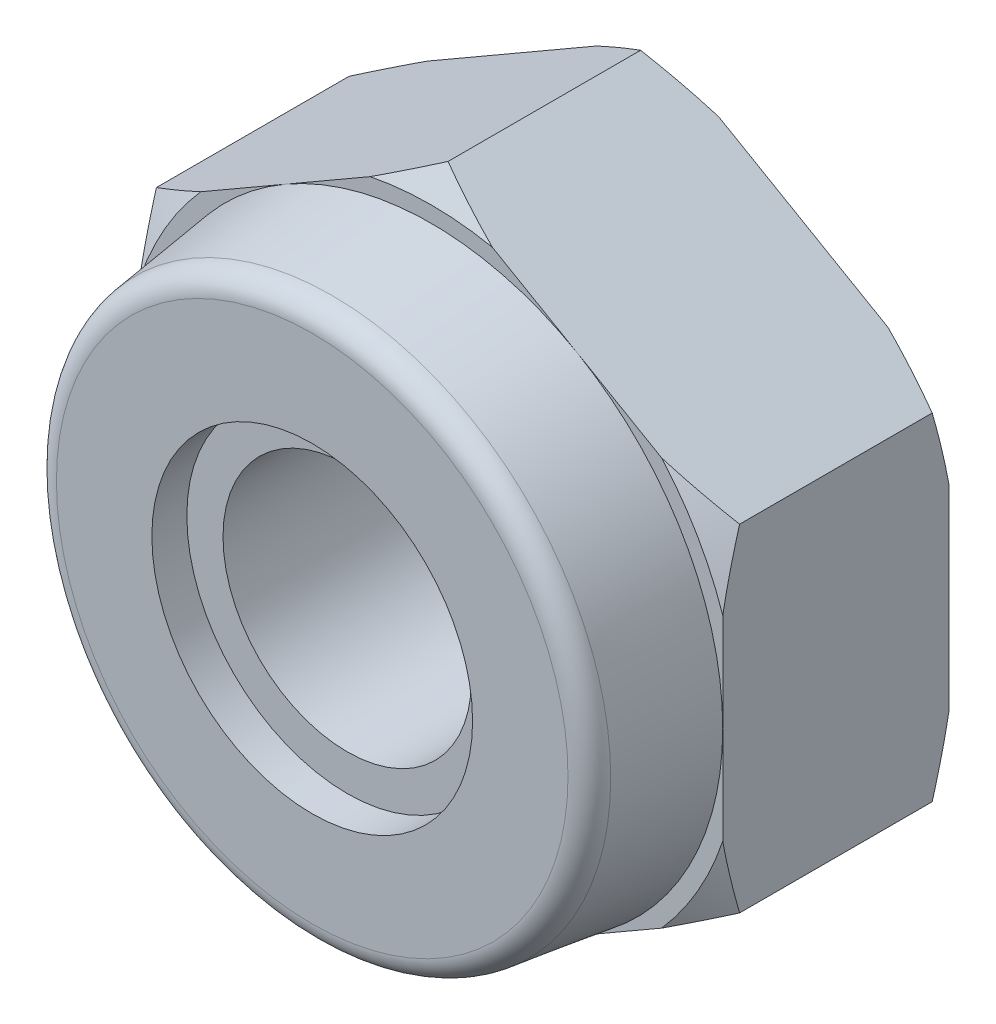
ISO-10303-21;
HEADER;
FILE_DESCRIPTION(('STEP AP214'),'2;1');
FILE_NAME('part.step','',(''),(''),'','','');
FILE_SCHEMA(('AUTOMOTIVE_DESIGN { 1 0 10303 214 1 1 1 1 }'));
ENDSEC;
DATA;
#1=APPLICATION_CONTEXT('core data for automotive mechanical design processes');
#2=APPLICATION_PROTOCOL_DEFINITION('international standard','automotive_design',2000,#1);
#3=PRODUCT_CONTEXT('',#1,'mechanical');
#4=PRODUCT('Part','Part','',(#3));
#5=PRODUCT_RELATED_PRODUCT_CATEGORY('part','',(#4));
#6=PRODUCT_DEFINITION_FORMATION('','',#4);
#7=PRODUCT_DEFINITION_CONTEXT('part definition',#1,'design');
#8=PRODUCT_DEFINITION('design','',#6,#7);
#9=PRODUCT_DEFINITION_SHAPE('','',#8);
#10=(LENGTH_UNIT() NAMED_UNIT(*) SI_UNIT(.MILLI.,.METRE.));
#11=(NAMED_UNIT(*) PLANE_ANGLE_UNIT() SI_UNIT($,.RADIAN.));
#12=(NAMED_UNIT(*) SI_UNIT($,.STERADIAN.) SOLID_ANGLE_UNIT());
#13=UNCERTAINTY_MEASURE_WITH_UNIT(LENGTH_MEASURE(1.E-05),#10,'distance_accuracy_value','');
#14=(GEOMETRIC_REPRESENTATION_CONTEXT(3) GLOBAL_UNCERTAINTY_ASSIGNED_CONTEXT((#13)) GLOBAL_UNIT_ASSIGNED_CONTEXT((#10,
#11,#12)) REPRESENTATION_CONTEXT('',''));
#15=CARTESIAN_POINT('',(0.,0.,0.));
#16=DIRECTION('',(0.,0.,1.));
#17=DIRECTION('',(1.,0.,0.));
#18=AXIS2_PLACEMENT_3D('',#15,#16,#17);
#19=CARTESIAN_POINT('',(-6.35,-10.9985226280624,0.));
#20=DIRECTION('',(0.,0.,-1.));
#21=DIRECTION('',(-1.,0.,0.));
#22=AXIS2_PLACEMENT_3D('',#19,#20,#21);
#23=PLANE('',#22);
#24=CARTESIAN_POINT('',(0.,0.,0.));
#25=DIRECTION('',(0.,0.,1.));
#26=DIRECTION('',(1.,0.,0.));
#27=AXIS2_PLACEMENT_3D('',#24,#25,#26);
#28=CIRCLE('',#27,6.69734841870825);
#29=CARTESIAN_POINT('',(6.35,2.12884378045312,0.));
#30=VERTEX_POINT('',#29);
#31=CARTESIAN_POINT('',(5.01863279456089,4.43483942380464,0.));
#32=VERTEX_POINT('',#31);
#33=EDGE_CURVE('E182',#30,#32,#28,.T.);
#34=ORIENTED_EDGE('',*,*,#33,.T.);
#35=DIRECTION('',(-0.866025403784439,0.5,0.));
#36=VECTOR('',#35,1.);
#37=CARTESIAN_POINT('',(6.35,3.66617420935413,0.));
#38=LINE('',#37,#36);
#39=CARTESIAN_POINT('',(3.175,5.49926131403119,0.));
#40=VERTEX_POINT('',#39);
#41=EDGE_CURVE('E198',#32,#40,#38,.T.);
#42=ORIENTED_EDGE('',*,*,#41,.T.);
#43=CARTESIAN_POINT('',(0.,0.,0.));
#44=DIRECTION('',(0.,0.,1.));
#45=DIRECTION('',(1.,0.,0.));
#46=AXIS2_PLACEMENT_3D('',#43,#44,#45);
#47=CIRCLE('',#46,6.35);
#48=CARTESIAN_POINT('',(6.35,0.,0.));
#49=VERTEX_POINT('',#48);
#50=EDGE_CURVE('E224',#49,#40,#47,.T.);
#51=ORIENTED_EDGE('',*,*,#50,.F.);
#52=DIRECTION('',(0.,1.,0.));
#53=VECTOR('',#52,1.);
#54=CARTESIAN_POINT('',(6.35,-3.66617420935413,0.));
#55=LINE('',#54,#53);
#56=EDGE_CURVE('E270',#49,#30,#55,.T.);
#57=ORIENTED_EDGE('',*,*,#56,.T.);
#58=EDGE_LOOP('',(#34,#42,#51,#57));
#59=FACE_BOUND('',#58,.T.);
#60=ADVANCED_FACE('F35',(#59),#23,.F.);
#61=CARTESIAN_POINT('',(1.33136720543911,6.56368320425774,0.));
#62=VERTEX_POINT('',#61);
#63=CARTESIAN_POINT('',(-1.33136720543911,6.56368320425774,0.));
#64=VERTEX_POINT('',#63);
#65=EDGE_CURVE('E459',#62,#64,#28,.T.);
#66=ORIENTED_EDGE('',*,*,#65,.T.);
#67=DIRECTION('',(-0.866025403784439,-0.5,0.));
#68=VECTOR('',#67,1.);
#69=CARTESIAN_POINT('',(0.,7.33234841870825,0.));
#70=LINE('',#69,#68);
#71=CARTESIAN_POINT('',(-3.175,5.49926131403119,0.));
#72=VERTEX_POINT('',#71);
#73=EDGE_CURVE('E277',#64,#72,#70,.T.);
#74=ORIENTED_EDGE('',*,*,#73,.T.);
#75=EDGE_CURVE('E216',#40,#72,#47,.T.);
#76=ORIENTED_EDGE('',*,*,#75,.F.);
#77=EDGE_CURVE('E274',#40,#62,#38,.T.);
#78=ORIENTED_EDGE('',*,*,#77,.T.);
#79=EDGE_LOOP('',(#66,#74,#76,#78));
#80=FACE_BOUND('',#79,.T.);
#81=ADVANCED_FACE('F399',(#80),#23,.F.);
#82=CARTESIAN_POINT('',(-5.01863279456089,4.43483942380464,0.));
#83=VERTEX_POINT('',#82);
#84=CARTESIAN_POINT('',(-6.35,2.1288437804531,0.));
#85=VERTEX_POINT('',#84);
#86=EDGE_CURVE('E462',#83,#85,#28,.T.);
#87=ORIENTED_EDGE('',*,*,#86,.T.);
#88=DIRECTION('',(0.,-1.,0.));
#89=VECTOR('',#88,1.);
#90=CARTESIAN_POINT('',(-6.35,3.66617420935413,0.));
#91=LINE('',#90,#89);
#92=CARTESIAN_POINT('',(-6.35,0.,0.));
#93=VERTEX_POINT('',#92);
#94=EDGE_CURVE('E280',#85,#93,#91,.T.);
#95=ORIENTED_EDGE('',*,*,#94,.T.);
#96=EDGE_CURVE('E222',#72,#93,#47,.T.);
#97=ORIENTED_EDGE('',*,*,#96,.F.);
#98=EDGE_CURVE('E276',#72,#83,#70,.T.);
#99=ORIENTED_EDGE('',*,*,#98,.T.);
#100=EDGE_LOOP('',(#87,#95,#97,#99));
#101=FACE_BOUND('',#100,.T.);
#102=ADVANCED_FACE('F452',(#101),#23,.F.);
#103=CARTESIAN_POINT('',(-6.35,-2.12884378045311,0.));
#104=VERTEX_POINT('',#103);
#105=CARTESIAN_POINT('',(-5.01863279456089,-4.43483942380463,0.));
#106=VERTEX_POINT('',#105);
#107=EDGE_CURVE('E59',#104,#106,#28,.T.);
#108=ORIENTED_EDGE('',*,*,#107,.T.);
#109=DIRECTION('',(0.866025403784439,-0.5,0.));
#110=VECTOR('',#109,1.);
#111=CARTESIAN_POINT('',(-6.35,-3.66617420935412,0.));
#112=LINE('',#111,#110);
#113=CARTESIAN_POINT('',(-3.175,-5.49926131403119,0.));
#114=VERTEX_POINT('',#113);
#115=EDGE_CURVE('E257',#106,#114,#112,.T.);
#116=ORIENTED_EDGE('',*,*,#115,.T.);
#117=EDGE_CURVE('E446',#93,#114,#47,.T.);
#118=ORIENTED_EDGE('',*,*,#117,.F.);
#119=EDGE_CURVE('E279',#93,#104,#91,.T.);
#120=ORIENTED_EDGE('',*,*,#119,.T.);
#121=EDGE_LOOP('',(#108,#116,#118,#120));
#122=FACE_BOUND('',#121,.T.);
#123=ADVANCED_FACE('F637',(#122),#23,.F.);
#124=CARTESIAN_POINT('',(-1.3313672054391,-6.56368320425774,0.));
#125=VERTEX_POINT('',#124);
#126=CARTESIAN_POINT('',(1.33136720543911,-6.56368320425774,0.));
#127=VERTEX_POINT('',#126);
#128=EDGE_CURVE('E51',#125,#127,#28,.T.);
#129=ORIENTED_EDGE('',*,*,#128,.T.);
#130=DIRECTION('',(0.866025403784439,0.5,0.));
#131=VECTOR('',#130,1.);
#132=CARTESIAN_POINT('',(0.,-7.33234841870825,0.));
#133=LINE('',#132,#131);
#134=CARTESIAN_POINT('',(3.175,-5.49926131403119,0.));
#135=VERTEX_POINT('',#134);
#136=EDGE_CURVE('E268',#127,#135,#133,.T.);
#137=ORIENTED_EDGE('',*,*,#136,.T.);
#138=EDGE_CURVE('E445',#114,#135,#47,.T.);
#139=ORIENTED_EDGE('',*,*,#138,.F.);
#140=EDGE_CURVE('E282',#114,#125,#112,.T.);
#141=ORIENTED_EDGE('',*,*,#140,.T.);
#142=EDGE_LOOP('',(#129,#137,#139,#141));
#143=FACE_BOUND('',#142,.T.);
#144=ADVANCED_FACE('F588',(#143),#23,.F.);
#145=CARTESIAN_POINT('',(0.,-7.33234841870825,-4.9276));
#146=DIRECTION('',(0.5,-0.866025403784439,0.));
#147=DIRECTION('',(0.866025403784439,0.5,0.));
#148=AXIS2_PLACEMENT_3D('',#145,#146,#147);
#149=PLANE('',#148);
#150=DIRECTION('',(0.,0.,1.));
#151=VECTOR('',#150,1.);
#152=CARTESIAN_POINT('',(6.35,-3.66617420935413,-4.9276));
#153=LINE('',#152,#151);
#154=CARTESIAN_POINT('',(6.35,-3.66617420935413,-4.56098257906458));
#155=VERTEX_POINT('',#154);
#156=CARTESIAN_POINT('',(6.35,-3.66617420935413,-0.36661742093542));
#157=VERTEX_POINT('',#156);
#158=EDGE_CURVE('E206',#155,#157,#153,.T.);
#159=ORIENTED_EDGE('',*,*,#158,.T.);
#160=CARTESIAN_POINT('',(10.7551048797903,-1.12288572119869,-2.37649782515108));
#161=CARTESIAN_POINT('',(10.5556179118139,-1.23805957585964,-2.26887482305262));
#162=CARTESIAN_POINT('',(10.3556531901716,-1.35350926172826,-2.16241442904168));
#163=CARTESIAN_POINT('',(9.9545667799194,-1.58507660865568,-1.95236489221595));
#164=CARTESIAN_POINT('',(9.75344494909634,-1.70119435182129,-1.84877611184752));
#165=CARTESIAN_POINT('',(9.34924411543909,-1.93455981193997,-1.64471562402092));
#166=CARTESIAN_POINT('',(9.14616089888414,-2.05180996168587,-1.54425501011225));
#167=CARTESIAN_POINT('',(8.73847187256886,-2.28718933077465,-1.34755048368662));
#168=CARTESIAN_POINT('',(8.53386611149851,-2.40531852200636,-1.25130643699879));
#169=CARTESIAN_POINT('',(8.11767707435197,-2.64560537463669,-1.06158284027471));
#170=CARTESIAN_POINT('',(7.90604844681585,-2.7677892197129,-0.968235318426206));
#171=CARTESIAN_POINT('',(7.48065548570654,-3.01338996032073,-0.788199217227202));
#172=CARTESIAN_POINT('',(7.26689104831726,-3.1368069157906,-0.701510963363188));
#173=CARTESIAN_POINT('',(6.83717745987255,-3.38490217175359,-0.536445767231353));
#174=CARTESIAN_POINT('',(6.621230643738,-3.50957912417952,-0.458060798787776));
#175=CARTESIAN_POINT('',(6.18680166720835,-3.76039681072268,-0.311413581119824));
#176=CARTESIAN_POINT('',(5.96831983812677,-3.88653735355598,-0.243150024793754));
#177=CARTESIAN_POINT('',(5.44576116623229,-4.18823674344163,-0.0955063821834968));
#178=CARTESIAN_POINT('',(5.14046643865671,-4.36449873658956,-0.0216369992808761));
#179=CARTESIAN_POINT('',(4.67939782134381,-4.63069682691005,0.0671019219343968));
#180=CARTESIAN_POINT('',(4.52518980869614,-4.71972886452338,0.0930037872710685));
#181=CARTESIAN_POINT('',(4.2159301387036,-4.89828001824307,0.136800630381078));
#182=CARTESIAN_POINT('',(4.06087859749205,-4.98779906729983,0.154696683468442));
#183=CARTESIAN_POINT('',(3.75200266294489,-5.16612867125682,0.181813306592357));
#184=CARTESIAN_POINT('',(3.59818473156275,-5.25493549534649,0.191131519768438));
#185=CARTESIAN_POINT('',(3.29033782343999,-5.43267099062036,0.201167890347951));
#186=CARTESIAN_POINT('',(3.13630884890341,-5.52159966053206,0.201886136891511));
#187=CARTESIAN_POINT('',(2.82840313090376,-5.69936910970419,0.194699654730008));
#188=CARTESIAN_POINT('',(2.6745263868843,-5.78820988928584,0.186794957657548));
#189=CARTESIAN_POINT('',(2.36725230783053,-5.96561466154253,0.162601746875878));
#190=CARTESIAN_POINT('',(2.21385504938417,-6.05417860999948,0.146311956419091));
#191=CARTESIAN_POINT('',(1.85133855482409,-6.26347760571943,0.0983195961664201));
#192=CARTESIAN_POINT('',(1.64256124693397,-6.38401524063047,0.0631467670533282));
#193=CARTESIAN_POINT('',(1.22700791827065,-6.62393506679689,-0.0204279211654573));
#194=CARTESIAN_POINT('',(1.0202321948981,-6.74331708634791,-0.0688317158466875));
#195=CARTESIAN_POINT('',(0.608706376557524,-6.98091162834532,-0.177040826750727));
#196=CARTESIAN_POINT('',(0.403958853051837,-7.09912266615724,-0.236859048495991));
#197=CARTESIAN_POINT('',(-0.00323669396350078,-7.33421712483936,-0.366012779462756));
#198=CARTESIAN_POINT('',(-0.205684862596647,-7.45110062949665,-0.435347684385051));
#199=CARTESIAN_POINT('',(-0.610815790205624,-7.68500307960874,-0.582759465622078));
#200=CARTESIAN_POINT('',(-0.813472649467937,-7.80200707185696,-0.660930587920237));
#201=CARTESIAN_POINT('',(-1.21663952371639,-8.03477557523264,-0.823826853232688));
#202=CARTESIAN_POINT('',(-1.41715086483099,-8.15054085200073,-0.908547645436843));
#203=CARTESIAN_POINT('',(-1.81634648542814,-8.38101655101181,-1.08338076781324));
#204=CARTESIAN_POINT('',(-2.01503114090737,-8.4957271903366,-1.17349195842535));
#205=CARTESIAN_POINT('',(-2.41084340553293,-8.72424950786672,-1.35816207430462));
#206=CARTESIAN_POINT('',(-2.60797098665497,-8.83806116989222,-1.45272107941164));
#207=CARTESIAN_POINT('',(-2.93964109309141,-9.02955099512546,-1.61547128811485));
#208=CARTESIAN_POINT('',(-3.07454106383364,-9.10743552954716,-1.68269534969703));
#209=CARTESIAN_POINT('',(-3.34375460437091,-9.26286603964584,-1.81867736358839));
#210=CARTESIAN_POINT('',(-3.47806819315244,-9.34041202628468,-1.88743526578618));
#211=CARTESIAN_POINT('',(-3.74476587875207,-9.49439000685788,-2.02557870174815));
#212=CARTESIAN_POINT('',(-3.87715545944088,-9.57082516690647,-2.09495014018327));
#213=CARTESIAN_POINT('',(-4.14146849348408,-9.72342636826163,-2.23487453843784));
#214=CARTESIAN_POINT('',(-4.27339193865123,-9.79959240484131,-2.30542751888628));
#215=CARTESIAN_POINT('',(-4.40510487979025,-9.87563690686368,-2.37649782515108));
#216=B_SPLINE_CURVE_WITH_KNOTS('',3,(#160,#161,#162,#163,#164,#165,#166,#167,#168,#169,#170,
#171,#172,#173,#174,#175,#176,#177,#178,#179,#180,#181,#182,#183,#184,#185,#186,#187,#188,#189,
#190,#191,#192,#193,#194,#195,#196,#197,#198,#199,#200,#201,#202,#203,#204,#205,#206,#207,#208,
#209,#210,#211,#212,#213,#214,#215),.UNSPECIFIED.,.F.,.F.,(4,2,2,2,2,2,2,2,2,2,2,2,2,2,2,2,2,2,
2,2,2,2,2,2,2,2,2,4),(0.,0.762756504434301,1.52560884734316,2.29091405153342,3.05619488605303,
3.84088556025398,4.6256145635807,5.40957796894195,6.19344004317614,7.27280654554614,
7.81247168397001,8.3520643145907,8.88543583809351,9.4188018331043,9.95216587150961,
10.4856111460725,11.2160517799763,11.9465993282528,12.6779778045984,13.4093098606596,
14.1493483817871,14.8888994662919,15.6282947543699,16.3677033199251,16.8766625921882,
17.3856052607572,17.8892225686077,18.3928486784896),.UNSPECIFIED.);
#217=CARTESIAN_POINT('',(5.01863279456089,-4.43483942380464,0.));
#218=VERTEX_POINT('',#217);
#219=EDGE_CURVE('E187',#157,#218,#216,.T.);
#220=ORIENTED_EDGE('',*,*,#219,.T.);
#221=EDGE_CURVE('E271',#135,#218,#133,.T.);
#222=ORIENTED_EDGE('',*,*,#221,.F.);
#223=ORIENTED_EDGE('',*,*,#136,.F.);
#224=CARTESIAN_POINT('',(0.,-7.33234841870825,-0.36661742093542));
#225=VERTEX_POINT('',#224);
#226=EDGE_CURVE('E506',#127,#225,#216,.T.);
#227=ORIENTED_EDGE('',*,*,#226,.T.);
#228=DIRECTION('',(0.,0.,1.));
#229=VECTOR('',#228,1.);
#230=CARTESIAN_POINT('',(0.,-7.33234841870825,-4.9276));
#231=LINE('',#230,#229);
#232=CARTESIAN_POINT('',(0.,-7.33234841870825,-4.56098257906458));
#233=VERTEX_POINT('',#232);
#234=EDGE_CURVE('E284',#233,#225,#231,.T.);
#235=ORIENTED_EDGE('',*,*,#234,.F.);
#236=CARTESIAN_POINT('',(10.7551048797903,-1.12288572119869,-2.55110217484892));
#237=CARTESIAN_POINT('',(10.5556179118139,-1.23805957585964,-2.65872517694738));
#238=CARTESIAN_POINT('',(10.3556531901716,-1.35350926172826,-2.76518557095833));
#239=CARTESIAN_POINT('',(9.9545667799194,-1.58507660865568,-2.97523510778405));
#240=CARTESIAN_POINT('',(9.75344494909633,-1.70119435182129,-3.07882388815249));
#241=CARTESIAN_POINT('',(9.34924411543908,-1.93455981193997,-3.28288437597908));
#242=CARTESIAN_POINT('',(9.14616089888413,-2.05180996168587,-3.38334498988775));
#243=CARTESIAN_POINT('',(8.73847187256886,-2.28718933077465,-3.58004951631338));
#244=CARTESIAN_POINT('',(8.53386611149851,-2.40531852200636,-3.67629356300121));
#245=CARTESIAN_POINT('',(8.11767707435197,-2.64560537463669,-3.8660171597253));
#246=CARTESIAN_POINT('',(7.90604844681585,-2.7677892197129,-3.9593646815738));
#247=CARTESIAN_POINT('',(7.48065548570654,-3.01338996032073,-4.1394007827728));
#248=CARTESIAN_POINT('',(7.26689104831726,-3.1368069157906,-4.22608903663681));
#249=CARTESIAN_POINT('',(6.83717745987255,-3.38490217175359,-4.39115423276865));
#250=CARTESIAN_POINT('',(6.62123064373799,-3.50957912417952,-4.46953920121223));
#251=CARTESIAN_POINT('',(6.18680166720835,-3.76039681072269,-4.61618641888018));
#252=CARTESIAN_POINT('',(5.96831983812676,-3.88653735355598,-4.68444997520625));
#253=CARTESIAN_POINT('',(5.44576116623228,-4.18823674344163,-4.8320936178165));
#254=CARTESIAN_POINT('',(5.14046643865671,-4.36449873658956,-4.90596300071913));
#255=CARTESIAN_POINT('',(4.6793978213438,-4.63069682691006,-4.9947019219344));
#256=CARTESIAN_POINT('',(4.52518980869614,-4.71972886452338,-5.02060378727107));
#257=CARTESIAN_POINT('',(4.21593013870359,-4.89828001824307,-5.06440063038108));
#258=CARTESIAN_POINT('',(4.06087859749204,-4.98779906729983,-5.08229668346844));
#259=CARTESIAN_POINT('',(3.75200266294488,-5.16612867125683,-5.10941330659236));
#260=CARTESIAN_POINT('',(3.59818473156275,-5.2549354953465,-5.11873151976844));
#261=CARTESIAN_POINT('',(3.29033782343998,-5.43267099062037,-5.12876789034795));
#262=CARTESIAN_POINT('',(3.1363088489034,-5.52159966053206,-5.12948613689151));
#263=CARTESIAN_POINT('',(2.82840313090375,-5.69936910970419,-5.12229965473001));
#264=CARTESIAN_POINT('',(2.67452638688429,-5.78820988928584,-5.11439495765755));
#265=CARTESIAN_POINT('',(2.36725230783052,-5.96561466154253,-5.09020174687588));
#266=CARTESIAN_POINT('',(2.21385504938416,-6.05417860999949,-5.07391195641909));
#267=CARTESIAN_POINT('',(1.85133855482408,-6.26347760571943,-5.02591959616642));
#268=CARTESIAN_POINT('',(1.64256124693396,-6.38401524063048,-4.99074676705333));
#269=CARTESIAN_POINT('',(1.22700791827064,-6.62393506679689,-4.90717207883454));
#270=CARTESIAN_POINT('',(1.02023219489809,-6.74331708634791,-4.85876828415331));
#271=CARTESIAN_POINT('',(0.608706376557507,-6.98091162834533,-4.75055917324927));
#272=CARTESIAN_POINT('',(0.403958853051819,-7.09912266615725,-4.690740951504));
#273=CARTESIAN_POINT('',(-0.00323669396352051,-7.33421712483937,-4.56158722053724));
#274=CARTESIAN_POINT('',(-0.205684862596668,-7.45110062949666,-4.49225231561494));
#275=CARTESIAN_POINT('',(-0.610815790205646,-7.68500307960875,-4.34484053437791));
#276=CARTESIAN_POINT('',(-0.813472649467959,-7.80200707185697,-4.26666941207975));
#277=CARTESIAN_POINT('',(-1.21663952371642,-8.03477557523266,-4.1037731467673));
#278=CARTESIAN_POINT('',(-1.41715086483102,-8.15054085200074,-4.01905235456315));
#279=CARTESIAN_POINT('',(-1.81634648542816,-8.38101655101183,-3.84421923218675));
#280=CARTESIAN_POINT('',(-2.0150311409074,-8.49572719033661,-3.75410804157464));
#281=CARTESIAN_POINT('',(-2.41084340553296,-8.72424950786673,-3.56943792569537));
#282=CARTESIAN_POINT('',(-2.607970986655,-8.83806116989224,-3.47487892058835));
#283=CARTESIAN_POINT('',(-2.93964109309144,-9.02955099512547,-3.31212871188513));
#284=CARTESIAN_POINT('',(-3.07454106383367,-9.10743552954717,-3.24490465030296));
#285=CARTESIAN_POINT('',(-3.34375460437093,-9.26286603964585,-3.1089226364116));
#286=CARTESIAN_POINT('',(-3.47806819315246,-9.34041202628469,-3.04016473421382));
#287=CARTESIAN_POINT('',(-3.74476587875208,-9.49439000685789,-2.90202129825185));
#288=CARTESIAN_POINT('',(-3.87715545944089,-9.57082516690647,-2.83264985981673));
#289=CARTESIAN_POINT('',(-4.14146849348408,-9.72342636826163,-2.69272546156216));
#290=CARTESIAN_POINT('',(-4.27339193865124,-9.79959240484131,-2.62217248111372));
#291=CARTESIAN_POINT('',(-4.40510487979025,-9.87563690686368,-2.55110217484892));
#292=B_SPLINE_CURVE_WITH_KNOTS('',3,(#236,#237,#238,#239,#240,#241,#242,#243,#244,#245,#246,
#247,#248,#249,#250,#251,#252,#253,#254,#255,#256,#257,#258,#259,#260,#261,#262,#263,#264,#265,
#266,#267,#268,#269,#270,#271,#272,#273,#274,#275,#276,#277,#278,#279,#280,#281,#282,#283,#284,
#285,#286,#287,#288,#289,#290,#291),.UNSPECIFIED.,.F.,.F.,(4,2,2,2,2,2,2,2,2,2,2,2,2,2,2,2,2,2,
2,2,2,2,2,2,2,2,2,4),(0.,0.762756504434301,1.52560884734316,2.29091405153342,3.05619488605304,
3.84088556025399,4.6256145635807,5.40957796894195,6.19344004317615,7.27280654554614,
7.81247168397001,8.3520643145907,8.88543583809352,9.41880183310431,9.95216587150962,
10.4856111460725,11.2160517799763,11.9465993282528,12.6779778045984,13.4093098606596,
14.1493483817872,14.8888994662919,15.62829475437,16.3677033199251,16.8766625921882,
17.3856052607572,17.8892225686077,18.3928486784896),.UNSPECIFIED.);
#293=CARTESIAN_POINT('',(1.33136720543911,-6.56368320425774,-4.9276));
#294=VERTEX_POINT('',#293);
#295=EDGE_CURVE('E443',#294,#233,#292,.T.);
#296=ORIENTED_EDGE('',*,*,#295,.F.);
#297=DIRECTION('',(0.866025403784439,0.5,0.));
#298=VECTOR('',#297,1.);
#299=CARTESIAN_POINT('',(0.,-7.33234841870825,-4.9276));
#300=LINE('',#299,#298);
#301=CARTESIAN_POINT('',(5.01863279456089,-4.43483942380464,-4.9276));
#302=VERTEX_POINT('',#301);
#303=EDGE_CURVE('E252',#294,#302,#300,.T.);
#304=ORIENTED_EDGE('',*,*,#303,.T.);
#305=EDGE_CURVE('E238',#155,#302,#292,.T.);
#306=ORIENTED_EDGE('',*,*,#305,.F.);
#307=EDGE_LOOP('',(#159,#220,#222,#223,#227,#235,#296,#304,#306));
#308=FACE_BOUND('',#307,.T.);
#309=ADVANCED_FACE('F37',(#308),#149,.T.);
#310=CARTESIAN_POINT('',(-6.35,-3.66617420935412,-4.9276));
#311=DIRECTION('',(-0.5,-0.866025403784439,0.));
#312=DIRECTION('',(0.866025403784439,-0.5,0.));
#313=AXIS2_PLACEMENT_3D('',#310,#311,#312);
#314=PLANE('',#313);
#315=ORIENTED_EDGE('',*,*,#234,.T.);
#316=CARTESIAN_POINT('',(4.40510487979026,-9.87563690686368,-2.37649782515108));
#317=CARTESIAN_POINT('',(4.20561791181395,-9.76046305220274,-2.26887482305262));
#318=CARTESIAN_POINT('',(4.00565319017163,-9.64501336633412,-2.16241442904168));
#319=CARTESIAN_POINT('',(3.6045667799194,-9.4134460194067,-1.95236489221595));
#320=CARTESIAN_POINT('',(3.40344494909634,-9.29732827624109,-1.84877611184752));
#321=CARTESIAN_POINT('',(2.99924411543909,-9.06396281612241,-1.64471562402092));
#322=CARTESIAN_POINT('',(2.79616089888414,-8.94671266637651,-1.54425501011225));
#323=CARTESIAN_POINT('',(2.38847187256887,-8.71133329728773,-1.34755048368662));
#324=CARTESIAN_POINT('',(2.18386611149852,-8.59320410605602,-1.2513064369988));
#325=CARTESIAN_POINT('',(1.76767707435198,-8.35291725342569,-1.06158284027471));
#326=CARTESIAN_POINT('',(1.55604844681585,-8.23073340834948,-0.968235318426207));
#327=CARTESIAN_POINT('',(1.13065548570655,-7.98513266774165,-0.788199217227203));
#328=CARTESIAN_POINT('',(0.916891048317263,-7.86171571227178,-0.701510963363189));
#329=CARTESIAN_POINT('',(0.487177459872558,-7.61362045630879,-0.536445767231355));
#330=CARTESIAN_POINT('',(0.271230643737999,-7.48894350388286,-0.458060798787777));
#331=CARTESIAN_POINT('',(-0.163198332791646,-7.23812581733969,-0.311413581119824));
#332=CARTESIAN_POINT('',(-0.381680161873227,-7.1119852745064,-0.243150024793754));
#333=CARTESIAN_POINT('',(-0.904238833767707,-6.81028588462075,-0.0955063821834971));
#334=CARTESIAN_POINT('',(-1.20953356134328,-6.63402389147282,-0.0216369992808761));
#335=CARTESIAN_POINT('',(-1.67060217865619,-6.36782580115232,0.0671019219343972));
#336=CARTESIAN_POINT('',(-1.82481019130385,-6.278793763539,0.093003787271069));
#337=CARTESIAN_POINT('',(-2.13406986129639,-6.10024260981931,0.136800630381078));
#338=CARTESIAN_POINT('',(-2.28912140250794,-6.01072356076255,0.154696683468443));
#339=CARTESIAN_POINT('',(-2.5979973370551,-5.83239395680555,0.181813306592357));
#340=CARTESIAN_POINT('',(-2.75181526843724,-5.74358713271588,0.191131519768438));
#341=CARTESIAN_POINT('',(-3.05966217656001,-5.56585163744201,0.201167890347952));
#342=CARTESIAN_POINT('',(-3.21369115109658,-5.47692296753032,0.201886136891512));
#343=CARTESIAN_POINT('',(-3.52159686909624,-5.29915351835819,0.194699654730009));
#344=CARTESIAN_POINT('',(-3.67547361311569,-5.21031273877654,0.186794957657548));
#345=CARTESIAN_POINT('',(-3.98274769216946,-5.03290796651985,0.162601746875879));
#346=CARTESIAN_POINT('',(-4.13614495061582,-4.94434401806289,0.146311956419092));
#347=CARTESIAN_POINT('',(-4.4986614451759,-4.73504502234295,0.0983195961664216));
#348=CARTESIAN_POINT('',(-4.70743875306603,-4.6145073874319,0.0631467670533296));
#349=CARTESIAN_POINT('',(-5.12299208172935,-4.37458756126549,-0.0204279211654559));
#350=CARTESIAN_POINT('',(-5.32976780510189,-4.25520554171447,-0.0688317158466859));
#351=CARTESIAN_POINT('',(-5.74129362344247,-4.01761099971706,-0.177040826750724));
#352=CARTESIAN_POINT('',(-5.94604114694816,-3.89939996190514,-0.236859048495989));
#353=CARTESIAN_POINT('',(-6.35323669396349,-3.66430550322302,-0.366012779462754));
#354=CARTESIAN_POINT('',(-6.55568486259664,-3.54742199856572,-0.435347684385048));
#355=CARTESIAN_POINT('',(-6.96081579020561,-3.31351954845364,-0.582759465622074));
#356=CARTESIAN_POINT('',(-7.16347264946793,-3.19651555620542,-0.660930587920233));
#357=CARTESIAN_POINT('',(-7.56663952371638,-2.96374705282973,-0.823826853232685));
#358=CARTESIAN_POINT('',(-7.76715086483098,-2.84798177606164,-0.90854764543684));
#359=CARTESIAN_POINT('',(-8.16634648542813,-2.61750607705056,-1.08338076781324));
#360=CARTESIAN_POINT('',(-8.36503114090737,-2.50279543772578,-1.17349195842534));
#361=CARTESIAN_POINT('',(-8.76084340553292,-2.27427312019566,-1.35816207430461));
#362=CARTESIAN_POINT('',(-8.95797098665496,-2.16046145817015,-1.45272107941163));
#363=CARTESIAN_POINT('',(-9.2896410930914,-1.96897163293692,-1.61547128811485));
#364=CARTESIAN_POINT('',(-9.42454106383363,-1.89108709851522,-1.68269534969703));
#365=CARTESIAN_POINT('',(-9.6937546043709,-1.73565658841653,-1.81867736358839));
#366=CARTESIAN_POINT('',(-9.82806819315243,-1.65811060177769,-1.88743526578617));
#367=CARTESIAN_POINT('',(-10.0947658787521,-1.50413262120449,-2.02557870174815));
#368=CARTESIAN_POINT('',(-10.2271554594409,-1.4276974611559,-2.09495014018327));
#369=CARTESIAN_POINT('',(-10.4914684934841,-1.27509625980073,-2.23487453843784));
#370=CARTESIAN_POINT('',(-10.6233919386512,-1.19893022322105,-2.30542751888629));
#371=CARTESIAN_POINT('',(-10.7551048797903,-1.12288572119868,-2.37649782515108));
#372=B_SPLINE_CURVE_WITH_KNOTS('',3,(#316,#317,#318,#319,#320,#321,#322,#323,#324,#325,#326,
#327,#328,#329,#330,#331,#332,#333,#334,#335,#336,#337,#338,#339,#340,#341,#342,#343,#344,#345,
#346,#347,#348,#349,#350,#351,#352,#353,#354,#355,#356,#357,#358,#359,#360,#361,#362,#363,#364,
#365,#366,#367,#368,#369,#370,#371),.UNSPECIFIED.,.F.,.F.,(4,2,2,2,2,2,2,2,2,2,2,2,2,2,2,2,2,2,
2,2,2,2,2,2,2,2,2,4),(0.,0.762756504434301,1.52560884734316,2.29091405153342,3.05619488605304,
3.84088556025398,4.6256145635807,5.40957796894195,6.19344004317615,7.27280654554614,
7.81247168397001,8.3520643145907,8.88543583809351,9.4188018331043,9.95216587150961,
10.4856111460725,11.2160517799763,11.9465993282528,12.6779778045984,13.4093098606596,
14.1493483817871,14.8888994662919,15.6282947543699,16.3677033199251,16.8766625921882,
17.3856052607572,17.8892225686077,18.3928486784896),.UNSPECIFIED.);
#373=EDGE_CURVE('E507',#225,#125,#372,.T.);
#374=ORIENTED_EDGE('',*,*,#373,.T.);
#375=ORIENTED_EDGE('',*,*,#140,.F.);
#376=ORIENTED_EDGE('',*,*,#115,.F.);
#377=CARTESIAN_POINT('',(-6.35,-3.66617420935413,-0.36661742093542));
#378=VERTEX_POINT('',#377);
#379=EDGE_CURVE('E312',#106,#378,#372,.T.);
#380=ORIENTED_EDGE('',*,*,#379,.T.);
#381=DIRECTION('',(0.,0.,1.));
#382=VECTOR('',#381,1.);
#383=CARTESIAN_POINT('',(-6.35,-3.66617420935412,-4.9276));
#384=LINE('',#383,#382);
#385=CARTESIAN_POINT('',(-6.35,-3.66617420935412,-4.56098257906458));
#386=VERTEX_POINT('',#385);
#387=EDGE_CURVE('E288',#386,#378,#384,.T.);
#388=ORIENTED_EDGE('',*,*,#387,.F.);
#389=CARTESIAN_POINT('',(4.40510487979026,-9.87563690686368,-2.55110217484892));
#390=CARTESIAN_POINT('',(4.20561791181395,-9.76046305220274,-2.65872517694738));
#391=CARTESIAN_POINT('',(4.00565319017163,-9.64501336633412,-2.76518557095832));
#392=CARTESIAN_POINT('',(3.6045667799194,-9.4134460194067,-2.97523510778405));
#393=CARTESIAN_POINT('',(3.40344494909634,-9.29732827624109,-3.07882388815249));
#394=CARTESIAN_POINT('',(2.99924411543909,-9.06396281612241,-3.28288437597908));
#395=CARTESIAN_POINT('',(2.79616089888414,-8.94671266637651,-3.38334498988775));
#396=CARTESIAN_POINT('',(2.38847187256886,-8.71133329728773,-3.58004951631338));
#397=CARTESIAN_POINT('',(2.18386611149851,-8.59320410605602,-3.67629356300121));
#398=CARTESIAN_POINT('',(1.76767707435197,-8.35291725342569,-3.8660171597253));
#399=CARTESIAN_POINT('',(1.55604844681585,-8.23073340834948,-3.9593646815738));
#400=CARTESIAN_POINT('',(1.13065548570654,-7.98513266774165,-4.1394007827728));
#401=CARTESIAN_POINT('',(0.916891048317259,-7.86171571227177,-4.22608903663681));
#402=CARTESIAN_POINT('',(0.487177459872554,-7.61362045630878,-4.39115423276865));
#403=CARTESIAN_POINT('',(0.271230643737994,-7.48894350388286,-4.46953920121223));
#404=CARTESIAN_POINT('',(-0.163198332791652,-7.23812581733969,-4.61618641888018));
#405=CARTESIAN_POINT('',(-0.381680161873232,-7.1119852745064,-4.68444997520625));
#406=CARTESIAN_POINT('',(-0.904238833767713,-6.81028588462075,-4.8320936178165));
#407=CARTESIAN_POINT('',(-1.20953356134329,-6.63402389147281,-4.90596300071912));
#408=CARTESIAN_POINT('',(-1.67060217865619,-6.36782580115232,-4.9947019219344));
#409=CARTESIAN_POINT('',(-1.82481019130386,-6.27879376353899,-5.02060378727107));
#410=CARTESIAN_POINT('',(-2.1340698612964,-6.1002426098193,-5.06440063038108));
#411=CARTESIAN_POINT('',(-2.28912140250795,-6.01072356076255,-5.08229668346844));
#412=CARTESIAN_POINT('',(-2.59799733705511,-5.83239395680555,-5.10941330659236));
#413=CARTESIAN_POINT('',(-2.75181526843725,-5.74358713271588,-5.11873151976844));
#414=CARTESIAN_POINT('',(-3.05966217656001,-5.56585163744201,-5.12876789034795));
#415=CARTESIAN_POINT('',(-3.21369115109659,-5.47692296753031,-5.12948613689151));
#416=CARTESIAN_POINT('',(-3.52159686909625,-5.29915351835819,-5.12229965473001));
#417=CARTESIAN_POINT('',(-3.6754736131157,-5.21031273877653,-5.11439495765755));
#418=CARTESIAN_POINT('',(-3.98274769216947,-5.03290796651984,-5.09020174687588));
#419=CARTESIAN_POINT('',(-4.13614495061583,-4.94434401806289,-5.07391195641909));
#420=CARTESIAN_POINT('',(-4.49866144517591,-4.73504502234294,-5.02591959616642));
#421=CARTESIAN_POINT('',(-4.70743875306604,-4.61450738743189,-4.99074676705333));
#422=CARTESIAN_POINT('',(-5.12299208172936,-4.37458756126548,-4.90717207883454));
#423=CARTESIAN_POINT('',(-5.32976780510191,-4.25520554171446,-4.85876828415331));
#424=CARTESIAN_POINT('',(-5.74129362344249,-4.01761099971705,-4.75055917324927));
#425=CARTESIAN_POINT('',(-5.94604114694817,-3.89939996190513,-4.69074095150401));
#426=CARTESIAN_POINT('',(-6.35323669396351,-3.66430550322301,-4.56158722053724));
#427=CARTESIAN_POINT('',(-6.55568486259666,-3.54742199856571,-4.49225231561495));
#428=CARTESIAN_POINT('',(-6.96081579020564,-3.31351954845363,-4.34484053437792));
#429=CARTESIAN_POINT('',(-7.16347264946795,-3.1965155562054,-4.26666941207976));
#430=CARTESIAN_POINT('',(-7.56663952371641,-2.96374705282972,-4.10377314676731));
#431=CARTESIAN_POINT('',(-7.76715086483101,-2.84798177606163,-4.01905235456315));
#432=CARTESIAN_POINT('',(-8.16634648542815,-2.61750607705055,-3.84421923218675));
#433=CARTESIAN_POINT('',(-8.36503114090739,-2.50279543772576,-3.75410804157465));
#434=CARTESIAN_POINT('',(-8.76084340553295,-2.27427312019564,-3.56943792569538));
#435=CARTESIAN_POINT('',(-8.95797098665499,-2.16046145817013,-3.47487892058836));
#436=CARTESIAN_POINT('',(-9.28964109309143,-1.9689716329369,-3.31212871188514));
#437=CARTESIAN_POINT('',(-9.42454106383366,-1.8910870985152,-3.24490465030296));
#438=CARTESIAN_POINT('',(-9.69375460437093,-1.73565658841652,-3.1089226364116));
#439=CARTESIAN_POINT('',(-9.82806819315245,-1.65811060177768,-3.04016473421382));
#440=CARTESIAN_POINT('',(-10.0947658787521,-1.50413262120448,-2.90202129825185));
#441=CARTESIAN_POINT('',(-10.2271554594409,-1.4276974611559,-2.83264985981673));
#442=CARTESIAN_POINT('',(-10.4914684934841,-1.27509625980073,-2.69272546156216));
#443=CARTESIAN_POINT('',(-10.6233919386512,-1.19893022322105,-2.62217248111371));
#444=CARTESIAN_POINT('',(-10.7551048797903,-1.12288572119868,-2.55110217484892));
#445=B_SPLINE_CURVE_WITH_KNOTS('',3,(#389,#390,#391,#392,#393,#394,#395,#396,#397,#398,#399,
#400,#401,#402,#403,#404,#405,#406,#407,#408,#409,#410,#411,#412,#413,#414,#415,#416,#417,#418,
#419,#420,#421,#422,#423,#424,#425,#426,#427,#428,#429,#430,#431,#432,#433,#434,#435,#436,#437,
#438,#439,#440,#441,#442,#443,#444),.UNSPECIFIED.,.F.,.F.,(4,2,2,2,2,2,2,2,2,2,2,2,2,2,2,2,2,2,
2,2,2,2,2,2,2,2,2,4),(0.,0.762756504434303,1.52560884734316,2.29091405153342,3.05619488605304,
3.84088556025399,4.6256145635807,5.40957796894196,6.19344004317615,7.27280654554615,
7.81247168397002,8.3520643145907,8.88543583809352,9.41880183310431,9.95216587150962,
10.4856111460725,11.2160517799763,11.9465993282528,12.6779778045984,13.4093098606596,
14.1493483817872,14.8888994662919,15.6282947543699,16.3677033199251,16.8766625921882,
17.3856052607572,17.8892225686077,18.3928486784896),.UNSPECIFIED.);
#446=CARTESIAN_POINT('',(-5.01863279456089,-4.43483942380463,-4.9276));
#447=VERTEX_POINT('',#446);
#448=EDGE_CURVE('E385',#447,#386,#445,.T.);
#449=ORIENTED_EDGE('',*,*,#448,.F.);
#450=DIRECTION('',(0.866025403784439,-0.5,0.));
#451=VECTOR('',#450,1.);
#452=CARTESIAN_POINT('',(-6.35,-3.66617420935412,-4.9276));
#453=LINE('',#452,#451);
#454=CARTESIAN_POINT('',(-1.33136720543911,-6.56368320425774,-4.9276));
#455=VERTEX_POINT('',#454);
#456=EDGE_CURVE('E211',#447,#455,#453,.T.);
#457=ORIENTED_EDGE('',*,*,#456,.T.);
#458=EDGE_CURVE('E389',#233,#455,#445,.T.);
#459=ORIENTED_EDGE('',*,*,#458,.F.);
#460=EDGE_LOOP('',(#315,#374,#375,#376,#380,#388,#449,#457,#459));
#461=FACE_BOUND('',#460,.T.);
#462=ADVANCED_FACE('F391',(#461),#314,.T.);
#463=CARTESIAN_POINT('',(-6.35,3.66617420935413,-4.9276));
#464=DIRECTION('',(-1.,0.,0.));
#465=DIRECTION('',(0.,-1.,0.));
#466=AXIS2_PLACEMENT_3D('',#463,#464,#465);
#467=PLANE('',#466);
#468=ORIENTED_EDGE('',*,*,#387,.T.);
#469=CARTESIAN_POINT('',(-6.35,-8.07127908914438,-2.06253491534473));
#470=CARTESIAN_POINT('',(-6.35,-7.84188865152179,-1.95847569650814));
#471=CARTESIAN_POINT('',(-6.35,-7.6118702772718,-1.85577431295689));
#472=CARTESIAN_POINT('',(-6.35,-7.15030867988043,-1.65374613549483));
#473=CARTESIAN_POINT('',(-6.35,-6.91876518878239,-1.5544199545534));
#474=CARTESIAN_POINT('',(-6.35,-6.45299487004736,-1.35943217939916));
#475=CARTESIAN_POINT('',(-6.35,-6.21876086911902,-1.26378765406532));
#476=CARTESIAN_POINT('',(-6.35,-5.74831156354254,-1.07751496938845));
#477=CARTESIAN_POINT('',(-6.35,-5.51209635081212,-0.986886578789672));
#478=CARTESIAN_POINT('',(-6.35,-5.03846403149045,-0.81215807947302));
#479=CARTESIAN_POINT('',(-6.35,-4.80105717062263,-0.72803033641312));
#480=CARTESIAN_POINT('',(-6.35,-4.3237049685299,-0.567219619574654));
#481=CARTESIAN_POINT('',(-6.35,-4.08375950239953,-0.490537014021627));
#482=CARTESIAN_POINT('',(-6.35,-3.601456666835,-0.346378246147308));
#483=CARTESIAN_POINT('',(-6.35,-3.35910305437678,-0.278889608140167));
#484=CARTESIAN_POINT('',(-6.35,-2.87156871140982,-0.154915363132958));
#485=CARTESIAN_POINT('',(-6.35,-2.62638810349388,-0.0984292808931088));
#486=CARTESIAN_POINT('',(-6.35,-2.20308452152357,-0.0126601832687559));
#487=CARTESIAN_POINT('',(-6.35,-2.02560469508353,0.0197984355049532));
#488=CARTESIAN_POINT('',(-6.35,-1.66945753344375,0.0772405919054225));
#489=CARTESIAN_POINT('',(-6.35,-1.49079040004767,0.102225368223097));
#490=CARTESIAN_POINT('',(-6.35,-1.13253274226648,0.144065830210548));
#491=CARTESIAN_POINT('',(-6.35,-0.952942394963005,0.160923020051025));
#492=CARTESIAN_POINT('',(-6.35,-0.593155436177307,0.186025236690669));
#493=CARTESIAN_POINT('',(-6.35,-0.412958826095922,0.19427028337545));
#494=CARTESIAN_POINT('',(-6.35,-0.052466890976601,0.201890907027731));
#495=CARTESIAN_POINT('',(-6.35,0.127828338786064,0.201270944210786));
#496=CARTESIAN_POINT('',(-6.35,0.488167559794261,0.191192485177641));
#497=CARTESIAN_POINT('',(-6.35,0.668211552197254,0.181734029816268));
#498=CARTESIAN_POINT('',(-6.35,1.02764943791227,0.154267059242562));
#499=CARTESIAN_POINT('',(-6.35,1.20704330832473,0.136258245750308));
#500=CARTESIAN_POINT('',(-6.35,1.5648554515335,0.0922102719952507));
#501=CARTESIAN_POINT('',(-6.35,1.74327353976,0.066169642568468));
#502=CARTESIAN_POINT('',(-6.35,2.45345388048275,-0.0525754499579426));
#503=CARTESIAN_POINT('',(-6.35,2.9804408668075,-0.174674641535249));
#504=CARTESIAN_POINT('',(-6.35,3.7611991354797,-0.392265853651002));
#505=CARTESIAN_POINT('',(-6.35,4.02016794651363,-0.470663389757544));
#506=CARTESIAN_POINT('',(-6.35,4.5351236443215,-0.636776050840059));
#507=CARTESIAN_POINT('',(-6.35,4.79111073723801,-0.7244905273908));
#508=CARTESIAN_POINT('',(-6.35,5.30325417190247,-0.908439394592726));
#509=CARTESIAN_POINT('',(-6.35,5.5593794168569,-1.00475923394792));
#510=CARTESIAN_POINT('',(-6.35,6.06924226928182,-1.20355329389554));
#511=CARTESIAN_POINT('',(-6.35,6.32297972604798,-1.30602789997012));
#512=CARTESIAN_POINT('',(-6.35,6.82682693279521,-1.51527720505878));
#513=CARTESIAN_POINT('',(-6.35,7.07694941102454,-1.62202141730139));
#514=CARTESIAN_POINT('',(-6.35,7.57538363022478,-1.8394989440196));
#515=CARTESIAN_POINT('',(-6.35,7.82369580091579,-1.95023127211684));
#516=CARTESIAN_POINT('',(-6.35,8.07127908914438,-2.06253491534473));
#517=B_SPLINE_CURVE_WITH_KNOTS('',3,(#469,#470,#471,#472,#473,#474,#475,#476,#477,#478,#479,
#480,#481,#482,#483,#484,#485,#486,#487,#488,#489,#490,#491,#492,#493,#494,#495,#496,#497,#498,
#499,#500,#501,#502,#503,#504,#505,#506,#507,#508,#509,#510,#511,#512,#513,#514,#515,#516),
.UNSPECIFIED.,.F.,.F.,(4,2,2,2,2,2,2,2,2,2,2,2,2,2,2,2,2,2,2,2,2,2,2,4),(0.,0.755680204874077,
1.51149692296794,2.27047555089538,3.02941915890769,3.78493525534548,4.54048869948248,
5.29500646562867,6.04949163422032,6.59062397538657,7.1316665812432,7.67260901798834,
8.21355020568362,8.7542192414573,9.29488577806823,9.83557117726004,10.3763555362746,
11.9953835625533,12.8070498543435,13.6186596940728,14.4394871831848,15.2603661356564,
16.0761722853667,16.8917780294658),.UNSPECIFIED.);
#518=EDGE_CURVE('E310',#378,#104,#517,.T.);
#519=ORIENTED_EDGE('',*,*,#518,.T.);
#520=ORIENTED_EDGE('',*,*,#119,.F.);
#521=ORIENTED_EDGE('',*,*,#94,.F.);
#522=CARTESIAN_POINT('',(-6.35,3.66617420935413,-0.36661742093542));
#523=VERTEX_POINT('',#522);
#524=EDGE_CURVE('E306',#85,#523,#517,.T.);
#525=ORIENTED_EDGE('',*,*,#524,.T.);
#526=DIRECTION('',(0.,0.,1.));
#527=VECTOR('',#526,1.);
#528=CARTESIAN_POINT('',(-6.35,3.66617420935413,-4.9276));
#529=LINE('',#528,#527);
#530=CARTESIAN_POINT('',(-6.35,3.66617420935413,-4.56098257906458));
#531=VERTEX_POINT('',#530);
#532=EDGE_CURVE('E208',#531,#523,#529,.T.);
#533=ORIENTED_EDGE('',*,*,#532,.F.);
#534=CARTESIAN_POINT('',(-6.35,-8.07127908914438,-2.86506508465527));
#535=CARTESIAN_POINT('',(-6.35,-7.84188865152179,-2.96912430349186));
#536=CARTESIAN_POINT('',(-6.35,-7.6118702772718,-3.07182568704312));
#537=CARTESIAN_POINT('',(-6.35,-7.15030867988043,-3.27385386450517));
#538=CARTESIAN_POINT('',(-6.35,-6.91876518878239,-3.3731800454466));
#539=CARTESIAN_POINT('',(-6.35,-6.45299487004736,-3.56816782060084));
#540=CARTESIAN_POINT('',(-6.35,-6.21876086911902,-3.66381234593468));
#541=CARTESIAN_POINT('',(-6.35,-5.74831156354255,-3.85008503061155));
#542=CARTESIAN_POINT('',(-6.35,-5.51209635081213,-3.94071342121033));
#543=CARTESIAN_POINT('',(-6.35,-5.03846403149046,-4.11544192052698));
#544=CARTESIAN_POINT('',(-6.35,-4.80105717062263,-4.19956966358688));
#545=CARTESIAN_POINT('',(-6.35,-4.3237049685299,-4.36038038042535));
#546=CARTESIAN_POINT('',(-6.35,-4.08375950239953,-4.43706298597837));
#547=CARTESIAN_POINT('',(-6.35,-3.601456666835,-4.58122175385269));
#548=CARTESIAN_POINT('',(-6.35,-3.35910305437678,-4.64871039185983));
#549=CARTESIAN_POINT('',(-6.35,-2.87156871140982,-4.77268463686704));
#550=CARTESIAN_POINT('',(-6.35,-2.62638810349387,-4.82917071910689));
#551=CARTESIAN_POINT('',(-6.35,-2.20308452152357,-4.91493981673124));
#552=CARTESIAN_POINT('',(-6.35,-2.02560469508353,-4.94739843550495));
#553=CARTESIAN_POINT('',(-6.35,-1.66945753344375,-5.00484059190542));
#554=CARTESIAN_POINT('',(-6.35,-1.49079040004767,-5.0298253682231));
#555=CARTESIAN_POINT('',(-6.35,-1.13253274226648,-5.07166583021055));
#556=CARTESIAN_POINT('',(-6.35,-0.952942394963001,-5.08852302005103));
#557=CARTESIAN_POINT('',(-6.35,-0.593155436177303,-5.11362523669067));
#558=CARTESIAN_POINT('',(-6.35,-0.412958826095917,-5.12187028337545));
#559=CARTESIAN_POINT('',(-6.35,-0.052466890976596,-5.12949090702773));
#560=CARTESIAN_POINT('',(-6.35,0.127828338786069,-5.12887094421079));
#561=CARTESIAN_POINT('',(-6.35,0.488167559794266,-5.11879248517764));
#562=CARTESIAN_POINT('',(-6.35,0.668211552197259,-5.10933402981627));
#563=CARTESIAN_POINT('',(-6.35,1.02764943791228,-5.08186705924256));
#564=CARTESIAN_POINT('',(-6.35,1.20704330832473,-5.06385824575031));
#565=CARTESIAN_POINT('',(-6.35,1.5648554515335,-5.01981027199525));
#566=CARTESIAN_POINT('',(-6.35,1.74327353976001,-4.99376964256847));
#567=CARTESIAN_POINT('',(-6.35,2.45345388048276,-4.87502455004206));
#568=CARTESIAN_POINT('',(-6.35,2.9804408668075,-4.75292535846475));
#569=CARTESIAN_POINT('',(-6.35,3.7611991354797,-4.535334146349));
#570=CARTESIAN_POINT('',(-6.35,4.02016794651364,-4.45693661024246));
#571=CARTESIAN_POINT('',(-6.35,4.5351236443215,-4.29082394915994));
#572=CARTESIAN_POINT('',(-6.35,4.79111073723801,-4.2031094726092));
#573=CARTESIAN_POINT('',(-6.35,5.30325417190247,-4.01916060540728));
#574=CARTESIAN_POINT('',(-6.35,5.5593794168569,-3.92284076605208));
#575=CARTESIAN_POINT('',(-6.35,6.06924226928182,-3.72404670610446));
#576=CARTESIAN_POINT('',(-6.35,6.32297972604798,-3.62157210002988));
#577=CARTESIAN_POINT('',(-6.35,6.82682693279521,-3.41232279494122));
#578=CARTESIAN_POINT('',(-6.35,7.07694941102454,-3.30557858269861));
#579=CARTESIAN_POINT('',(-6.35,7.57538363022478,-3.08810105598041));
#580=CARTESIAN_POINT('',(-6.35,7.82369580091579,-2.97736872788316));
#581=CARTESIAN_POINT('',(-6.35,8.07127908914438,-2.86506508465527));
#582=B_SPLINE_CURVE_WITH_KNOTS('',3,(#534,#535,#536,#537,#538,#539,#540,#541,#542,#543,#544,
#545,#546,#547,#548,#549,#550,#551,#552,#553,#554,#555,#556,#557,#558,#559,#560,#561,#562,#563,
#564,#565,#566,#567,#568,#569,#570,#571,#572,#573,#574,#575,#576,#577,#578,#579,#580,#581),
.UNSPECIFIED.,.F.,.F.,(4,2,2,2,2,2,2,2,2,2,2,2,2,2,2,2,2,2,2,2,2,2,2,4),(0.,0.755680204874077,
1.51149692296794,2.27047555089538,3.02941915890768,3.78493525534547,4.54048869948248,
5.29500646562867,6.04949163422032,6.59062397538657,7.13166658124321,7.67260901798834,
8.21355020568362,8.7542192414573,9.29488577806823,9.83557117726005,10.3763555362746,
11.9953835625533,12.8070498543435,13.6186596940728,14.4394871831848,15.2603661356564,
16.0761722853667,16.8917780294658),.UNSPECIFIED.);
#583=CARTESIAN_POINT('',(-6.35,2.12884378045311,-4.9276));
#584=VERTEX_POINT('',#583);
#585=EDGE_CURVE('E303',#584,#531,#582,.T.);
#586=ORIENTED_EDGE('',*,*,#585,.F.);
#587=DIRECTION('',(0.,-1.,0.));
#588=VECTOR('',#587,1.);
#589=CARTESIAN_POINT('',(-6.35,3.66617420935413,-4.9276));
#590=LINE('',#589,#588);
#591=CARTESIAN_POINT('',(-6.35,-2.12884378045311,-4.9276));
#592=VERTEX_POINT('',#591);
#593=EDGE_CURVE('E263',#584,#592,#590,.T.);
#594=ORIENTED_EDGE('',*,*,#593,.T.);
#595=EDGE_CURVE('E384',#386,#592,#582,.T.);
#596=ORIENTED_EDGE('',*,*,#595,.F.);
#597=EDGE_LOOP('',(#468,#519,#520,#521,#525,#533,#586,#594,#596));
#598=FACE_BOUND('',#597,.T.);
#599=ADVANCED_FACE('F302',(#598),#467,.T.);
#600=CARTESIAN_POINT('',(0.,7.33234841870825,-4.9276));
#601=DIRECTION('',(-0.5,0.866025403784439,0.));
#602=DIRECTION('',(-0.866025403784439,-0.5,0.));
#603=AXIS2_PLACEMENT_3D('',#600,#601,#602);
#604=PLANE('',#603);
#605=ORIENTED_EDGE('',*,*,#532,.T.);
#606=CARTESIAN_POINT('',(-10.7551048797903,1.12288572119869,-2.37649782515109));
#607=CARTESIAN_POINT('',(-10.555617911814,1.23805957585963,-2.26887482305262));
#608=CARTESIAN_POINT('',(-10.3556531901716,1.35350926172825,-2.16241442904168));
#609=CARTESIAN_POINT('',(-9.95456677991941,1.58507660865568,-1.95236489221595));
#610=CARTESIAN_POINT('',(-9.75344494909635,1.70119435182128,-1.84877611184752));
#611=CARTESIAN_POINT('',(-9.3492441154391,1.93455981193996,-1.64471562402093));
#612=CARTESIAN_POINT('',(-9.14616089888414,2.05180996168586,-1.54425501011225));
#613=CARTESIAN_POINT('',(-8.73847187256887,2.28718933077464,-1.34755048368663));
#614=CARTESIAN_POINT('',(-8.53386611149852,2.40531852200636,-1.2513064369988));
#615=CARTESIAN_POINT('',(-8.11767707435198,2.64560537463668,-1.06158284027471));
#616=CARTESIAN_POINT('',(-7.90604844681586,2.76778921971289,-0.968235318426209));
#617=CARTESIAN_POINT('',(-7.48065548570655,3.01338996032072,-0.788199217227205));
#618=CARTESIAN_POINT('',(-7.26689104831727,3.1368069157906,-0.701510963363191));
#619=CARTESIAN_POINT('',(-6.83717745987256,3.38490217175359,-0.536445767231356));
#620=CARTESIAN_POINT('',(-6.621230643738,3.50957912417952,-0.458060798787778));
#621=CARTESIAN_POINT('',(-6.18680166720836,3.76039681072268,-0.311413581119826));
#622=CARTESIAN_POINT('',(-5.96831983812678,3.88653735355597,-0.243150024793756));
#623=CARTESIAN_POINT('',(-5.4457611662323,4.18823674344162,-0.0955063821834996));
#624=CARTESIAN_POINT('',(-5.14046643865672,4.36449873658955,-0.0216369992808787));
#625=CARTESIAN_POINT('',(-4.67939782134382,4.63069682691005,0.0671019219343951));
#626=CARTESIAN_POINT('',(-4.52518980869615,4.71972886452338,0.0930037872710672));
#627=CARTESIAN_POINT('',(-4.21593013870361,4.89828001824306,0.136800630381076));
#628=CARTESIAN_POINT('',(-4.06087859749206,4.98779906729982,0.154696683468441));
#629=CARTESIAN_POINT('',(-3.7520026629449,5.16612867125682,0.181813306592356));
#630=CARTESIAN_POINT('',(-3.59818473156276,5.25493549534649,0.191131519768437));
#631=CARTESIAN_POINT('',(-3.29033782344,5.43267099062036,0.201167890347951));
#632=CARTESIAN_POINT('',(-3.13630884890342,5.52159966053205,0.201886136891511));
#633=CARTESIAN_POINT('',(-2.82840313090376,5.69936910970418,0.194699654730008));
#634=CARTESIAN_POINT('',(-2.67452638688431,5.78820988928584,0.186794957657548));
#635=CARTESIAN_POINT('',(-2.36725230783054,5.96561466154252,0.162601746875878));
#636=CARTESIAN_POINT('',(-2.21385504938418,6.05417860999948,0.14631195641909));
#637=CARTESIAN_POINT('',(-1.8513385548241,6.26347760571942,0.0983195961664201));
#638=CARTESIAN_POINT('',(-1.64256124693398,6.38401524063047,0.0631467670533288));
#639=CARTESIAN_POINT('',(-1.22700791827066,6.62393506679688,-0.020427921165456));
#640=CARTESIAN_POINT('',(-1.02023219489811,6.7433170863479,-0.068831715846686));
#641=CARTESIAN_POINT('',(-0.608706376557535,6.98091162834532,-0.177040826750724));
#642=CARTESIAN_POINT('',(-0.403958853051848,7.09912266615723,-0.236859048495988));
#643=CARTESIAN_POINT('',(0.00323669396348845,7.33421712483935,-0.366012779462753));
#644=CARTESIAN_POINT('',(0.205684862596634,7.45110062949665,-0.435347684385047));
#645=CARTESIAN_POINT('',(0.61081579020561,7.68500307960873,-0.582759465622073));
#646=CARTESIAN_POINT('',(0.813472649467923,7.80200707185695,-0.660930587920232));
#647=CARTESIAN_POINT('',(1.21663952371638,8.03477557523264,-0.823826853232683));
#648=CARTESIAN_POINT('',(1.41715086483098,8.15054085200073,-0.908547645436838));
#649=CARTESIAN_POINT('',(1.81634648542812,8.3810165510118,-1.08338076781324));
#650=CARTESIAN_POINT('',(2.01503114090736,8.49572719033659,-1.17349195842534));
#651=CARTESIAN_POINT('',(2.41084340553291,8.72424950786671,-1.35816207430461));
#652=CARTESIAN_POINT('',(2.60797098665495,8.83806116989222,-1.45272107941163));
#653=CARTESIAN_POINT('',(2.9396410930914,9.02955099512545,-1.61547128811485));
#654=CARTESIAN_POINT('',(3.07454106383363,9.10743552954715,-1.68269534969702));
#655=CARTESIAN_POINT('',(3.3437546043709,9.26286603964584,-1.81867736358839));
#656=CARTESIAN_POINT('',(3.47806819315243,9.34041202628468,-1.88743526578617));
#657=CARTESIAN_POINT('',(3.74476587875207,9.49439000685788,-2.02557870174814));
#658=CARTESIAN_POINT('',(3.87715545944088,9.57082516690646,-2.09495014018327));
#659=CARTESIAN_POINT('',(4.14146849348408,9.72342636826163,-2.23487453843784));
#660=CARTESIAN_POINT('',(4.27339193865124,9.79959240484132,-2.30542751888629));
#661=CARTESIAN_POINT('',(4.40510487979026,9.87563690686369,-2.37649782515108));
#662=B_SPLINE_CURVE_WITH_KNOTS('',3,(#606,#607,#608,#609,#610,#611,#612,#613,#614,#615,#616,
#617,#618,#619,#620,#621,#622,#623,#624,#625,#626,#627,#628,#629,#630,#631,#632,#633,#634,#635,
#636,#637,#638,#639,#640,#641,#642,#643,#644,#645,#646,#647,#648,#649,#650,#651,#652,#653,#654,
#655,#656,#657,#658,#659,#660,#661),.UNSPECIFIED.,.F.,.F.,(4,2,2,2,2,2,2,2,2,2,2,2,2,2,2,2,2,2,
2,2,2,2,2,2,2,2,2,4),(0.,0.762756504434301,1.52560884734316,2.29091405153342,3.05619488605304,
3.84088556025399,4.6256145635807,5.40957796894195,6.19344004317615,7.27280654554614,
7.81247168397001,8.3520643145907,8.88543583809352,9.4188018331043,9.95216587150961,
10.4856111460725,11.2160517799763,11.9465993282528,12.6779778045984,13.4093098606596,
14.1493483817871,14.8888994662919,15.6282947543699,16.3677033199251,16.8766625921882,
17.3856052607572,17.8892225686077,18.3928486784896),.UNSPECIFIED.);
#663=EDGE_CURVE('E297',#523,#83,#662,.T.);
#664=ORIENTED_EDGE('',*,*,#663,.T.);
#665=ORIENTED_EDGE('',*,*,#98,.F.);
#666=ORIENTED_EDGE('',*,*,#73,.F.);
#667=CARTESIAN_POINT('',(0.,7.33234841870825,-0.36661742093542));
#668=VERTEX_POINT('',#667);
#669=EDGE_CURVE('E313',#64,#668,#662,.T.);
#670=ORIENTED_EDGE('',*,*,#669,.T.);
#671=DIRECTION('',(0.,0.,1.));
#672=VECTOR('',#671,1.);
#673=CARTESIAN_POINT('',(0.,7.33234841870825,-4.9276));
#674=LINE('',#673,#672);
#675=CARTESIAN_POINT('',(0.,7.33234841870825,-4.56098257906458));
#676=VERTEX_POINT('',#675);
#677=EDGE_CURVE('E205',#676,#668,#674,.T.);
#678=ORIENTED_EDGE('',*,*,#677,.F.);
#679=CARTESIAN_POINT('',(-10.7551048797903,1.12288572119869,-2.55110217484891));
#680=CARTESIAN_POINT('',(-10.555617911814,1.23805957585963,-2.65872517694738));
#681=CARTESIAN_POINT('',(-10.3556531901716,1.35350926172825,-2.76518557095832));
#682=CARTESIAN_POINT('',(-9.95456677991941,1.58507660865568,-2.97523510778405));
#683=CARTESIAN_POINT('',(-9.75344494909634,1.70119435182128,-3.07882388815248));
#684=CARTESIAN_POINT('',(-9.3492441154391,1.93455981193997,-3.28288437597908));
#685=CARTESIAN_POINT('',(-9.14616089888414,2.05180996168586,-3.38334498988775));
#686=CARTESIAN_POINT('',(-8.73847187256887,2.28718933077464,-3.58004951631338));
#687=CARTESIAN_POINT('',(-8.53386611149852,2.40531852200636,-3.6762935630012));
#688=CARTESIAN_POINT('',(-8.11767707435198,2.64560537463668,-3.86601715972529));
#689=CARTESIAN_POINT('',(-7.90604844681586,2.76778921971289,-3.95936468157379));
#690=CARTESIAN_POINT('',(-7.48065548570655,3.01338996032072,-4.1394007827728));
#691=CARTESIAN_POINT('',(-7.26689104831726,3.1368069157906,-4.22608903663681));
#692=CARTESIAN_POINT('',(-6.83717745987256,3.38490217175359,-4.39115423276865));
#693=CARTESIAN_POINT('',(-6.621230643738,3.50957912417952,-4.46953920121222));
#694=CARTESIAN_POINT('',(-6.18680166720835,3.76039681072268,-4.61618641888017));
#695=CARTESIAN_POINT('',(-5.96831983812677,3.88653735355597,-4.68444997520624));
#696=CARTESIAN_POINT('',(-5.44576116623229,4.18823674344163,-4.8320936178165));
#697=CARTESIAN_POINT('',(-5.14046643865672,4.36449873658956,-4.90596300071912));
#698=CARTESIAN_POINT('',(-4.67939782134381,4.63069682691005,-4.9947019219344));
#699=CARTESIAN_POINT('',(-4.52518980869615,4.71972886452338,-5.02060378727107));
#700=CARTESIAN_POINT('',(-4.2159301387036,4.89828001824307,-5.06440063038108));
#701=CARTESIAN_POINT('',(-4.06087859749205,4.98779906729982,-5.08229668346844));
#702=CARTESIAN_POINT('',(-3.7520026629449,5.16612867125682,-5.10941330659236));
#703=CARTESIAN_POINT('',(-3.59818473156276,5.25493549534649,-5.11873151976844));
#704=CARTESIAN_POINT('',(-3.29033782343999,5.43267099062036,-5.12876789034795));
#705=CARTESIAN_POINT('',(-3.13630884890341,5.52159966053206,-5.12948613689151));
#706=CARTESIAN_POINT('',(-2.82840313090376,5.69936910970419,-5.12229965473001));
#707=CARTESIAN_POINT('',(-2.6745263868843,5.78820988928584,-5.11439495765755));
#708=CARTESIAN_POINT('',(-2.36725230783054,5.96561466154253,-5.09020174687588));
#709=CARTESIAN_POINT('',(-2.21385504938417,6.05417860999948,-5.07391195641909));
#710=CARTESIAN_POINT('',(-1.85133855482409,6.26347760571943,-5.02591959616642));
#711=CARTESIAN_POINT('',(-1.64256124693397,6.38401524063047,-4.99074676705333));
#712=CARTESIAN_POINT('',(-1.22700791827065,6.62393506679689,-4.90717207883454));
#713=CARTESIAN_POINT('',(-1.0202321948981,6.74331708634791,-4.85876828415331));
#714=CARTESIAN_POINT('',(-0.608706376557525,6.98091162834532,-4.75055917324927));
#715=CARTESIAN_POINT('',(-0.403958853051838,7.09912266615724,-4.69074095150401));
#716=CARTESIAN_POINT('',(0.00323669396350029,7.33421712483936,-4.56158722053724));
#717=CARTESIAN_POINT('',(0.205684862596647,7.45110062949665,-4.49225231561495));
#718=CARTESIAN_POINT('',(0.610815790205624,7.68500307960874,-4.34484053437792));
#719=CARTESIAN_POINT('',(0.813472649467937,7.80200707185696,-4.26666941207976));
#720=CARTESIAN_POINT('',(1.21663952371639,8.03477557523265,-4.10377314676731));
#721=CARTESIAN_POINT('',(1.417150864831,8.15054085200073,-4.01905235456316));
#722=CARTESIAN_POINT('',(1.81634648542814,8.38101655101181,-3.84421923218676));
#723=CARTESIAN_POINT('',(2.01503114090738,8.4957271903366,-3.75410804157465));
#724=CARTESIAN_POINT('',(2.41084340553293,8.72424950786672,-3.56943792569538));
#725=CARTESIAN_POINT('',(2.60797098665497,8.83806116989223,-3.47487892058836));
#726=CARTESIAN_POINT('',(2.93964109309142,9.02955099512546,-3.31212871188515));
#727=CARTESIAN_POINT('',(3.07454106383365,9.10743552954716,-3.24490465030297));
#728=CARTESIAN_POINT('',(3.34375460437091,9.26286603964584,-3.1089226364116));
#729=CARTESIAN_POINT('',(3.47806819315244,9.34041202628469,-3.04016473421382));
#730=CARTESIAN_POINT('',(3.74476587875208,9.49439000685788,-2.90202129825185));
#731=CARTESIAN_POINT('',(3.87715545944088,9.57082516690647,-2.83264985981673));
#732=CARTESIAN_POINT('',(4.14146849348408,9.72342636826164,-2.69272546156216));
#733=CARTESIAN_POINT('',(4.27339193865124,9.79959240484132,-2.62217248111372));
#734=CARTESIAN_POINT('',(4.40510487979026,9.87563690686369,-2.55110217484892));
#735=B_SPLINE_CURVE_WITH_KNOTS('',3,(#679,#680,#681,#682,#683,#684,#685,#686,#687,#688,#689,
#690,#691,#692,#693,#694,#695,#696,#697,#698,#699,#700,#701,#702,#703,#704,#705,#706,#707,#708,
#709,#710,#711,#712,#713,#714,#715,#716,#717,#718,#719,#720,#721,#722,#723,#724,#725,#726,#727,
#728,#729,#730,#731,#732,#733,#734),.UNSPECIFIED.,.F.,.F.,(4,2,2,2,2,2,2,2,2,2,2,2,2,2,2,2,2,2,
2,2,2,2,2,2,2,2,2,4),(0.,0.762756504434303,1.52560884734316,2.29091405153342,3.05619488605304,
3.84088556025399,4.6256145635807,5.40957796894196,6.19344004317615,7.27280654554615,
7.81247168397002,8.3520643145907,8.88543583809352,9.41880183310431,9.95216587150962,
10.4856111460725,11.2160517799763,11.9465993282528,12.6779778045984,13.4093098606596,
14.1493483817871,14.8888994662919,15.6282947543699,16.3677033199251,16.8766625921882,
17.3856052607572,17.8892225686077,18.3928486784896),.UNSPECIFIED.);
#736=CARTESIAN_POINT('',(-1.33136720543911,6.56368320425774,-4.9276));
#737=VERTEX_POINT('',#736);
#738=EDGE_CURVE('E375',#737,#676,#735,.T.);
#739=ORIENTED_EDGE('',*,*,#738,.F.);
#740=DIRECTION('',(-0.866025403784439,-0.5,0.));
#741=VECTOR('',#740,1.);
#742=CARTESIAN_POINT('',(0.,7.33234841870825,-4.9276));
#743=LINE('',#742,#741);
#744=CARTESIAN_POINT('',(-5.01863279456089,4.43483942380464,-4.9276));
#745=VERTEX_POINT('',#744);
#746=EDGE_CURVE('E255',#737,#745,#743,.T.);
#747=ORIENTED_EDGE('',*,*,#746,.T.);
#748=EDGE_CURVE('E299',#531,#745,#735,.T.);
#749=ORIENTED_EDGE('',*,*,#748,.F.);
#750=EDGE_LOOP('',(#605,#664,#665,#666,#670,#678,#739,#747,#749));
#751=FACE_BOUND('',#750,.T.);
#752=ADVANCED_FACE('F295',(#751),#604,.T.);
#753=CARTESIAN_POINT('',(6.35,3.66617420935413,-4.9276));
#754=DIRECTION('',(0.5,0.866025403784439,0.));
#755=DIRECTION('',(-0.866025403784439,0.5,0.));
#756=AXIS2_PLACEMENT_3D('',#753,#754,#755);
#757=PLANE('',#756);
#758=ORIENTED_EDGE('',*,*,#677,.T.);
#759=CARTESIAN_POINT('',(-4.40510487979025,9.87563690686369,-2.37649782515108));
#760=CARTESIAN_POINT('',(-4.20561791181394,9.76046305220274,-2.26887482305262));
#761=CARTESIAN_POINT('',(-4.00565319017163,9.64501336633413,-2.16241442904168));
#762=CARTESIAN_POINT('',(-3.6045667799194,9.4134460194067,-1.95236489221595));
#763=CARTESIAN_POINT('',(-3.40344494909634,9.29732827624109,-1.84877611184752));
#764=CARTESIAN_POINT('',(-2.99924411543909,9.06396281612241,-1.64471562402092));
#765=CARTESIAN_POINT('',(-2.79616089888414,8.94671266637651,-1.54425501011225));
#766=CARTESIAN_POINT('',(-2.38847187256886,8.71133329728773,-1.34755048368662));
#767=CARTESIAN_POINT('',(-2.18386611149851,8.59320410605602,-1.25130643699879));
#768=CARTESIAN_POINT('',(-1.76767707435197,8.35291725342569,-1.06158284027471));
#769=CARTESIAN_POINT('',(-1.55604844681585,8.23073340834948,-0.968235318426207));
#770=CARTESIAN_POINT('',(-1.13065548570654,7.98513266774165,-0.788199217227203));
#771=CARTESIAN_POINT('',(-0.91689104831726,7.86171571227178,-0.701510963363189));
#772=CARTESIAN_POINT('',(-0.487177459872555,7.61362045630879,-0.536445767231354));
#773=CARTESIAN_POINT('',(-0.271230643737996,7.48894350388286,-0.458060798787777));
#774=CARTESIAN_POINT('',(0.16319833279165,7.23812581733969,-0.311413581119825));
#775=CARTESIAN_POINT('',(0.38168016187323,7.1119852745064,-0.243150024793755));
#776=CARTESIAN_POINT('',(0.90423883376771,6.81028588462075,-0.0955063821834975));
#777=CARTESIAN_POINT('',(1.20953356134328,6.63402389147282,-0.0216369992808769));
#778=CARTESIAN_POINT('',(1.67060217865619,6.36782580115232,0.0671019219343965));
#779=CARTESIAN_POINT('',(1.82481019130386,6.278793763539,0.0930037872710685));
#780=CARTESIAN_POINT('',(2.1340698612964,6.10024260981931,0.136800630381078));
#781=CARTESIAN_POINT('',(2.28912140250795,6.01072356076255,0.154696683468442));
#782=CARTESIAN_POINT('',(2.59799733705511,5.83239395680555,0.181813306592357));
#783=CARTESIAN_POINT('',(2.75181526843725,5.74358713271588,0.191131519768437));
#784=CARTESIAN_POINT('',(3.05966217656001,5.56585163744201,0.201167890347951));
#785=CARTESIAN_POINT('',(3.21369115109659,5.47692296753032,0.201886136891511));
#786=CARTESIAN_POINT('',(3.52159686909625,5.29915351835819,0.194699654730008));
#787=CARTESIAN_POINT('',(3.6754736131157,5.21031273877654,0.186794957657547));
#788=CARTESIAN_POINT('',(3.98274769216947,5.03290796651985,0.162601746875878));
#789=CARTESIAN_POINT('',(4.13614495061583,4.94434401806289,0.14631195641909));
#790=CARTESIAN_POINT('',(4.49866144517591,4.73504502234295,0.0983195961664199));
#791=CARTESIAN_POINT('',(4.70743875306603,4.6145073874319,0.0631467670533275));
#792=CARTESIAN_POINT('',(5.12299208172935,4.37458756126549,-0.0204279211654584));
#793=CARTESIAN_POINT('',(5.3297678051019,4.25520554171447,-0.0688317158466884));
#794=CARTESIAN_POINT('',(5.74129362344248,4.01761099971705,-0.177040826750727));
#795=CARTESIAN_POINT('',(5.94604114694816,3.89939996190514,-0.236859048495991));
#796=CARTESIAN_POINT('',(6.3532366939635,3.66430550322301,-0.366012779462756));
#797=CARTESIAN_POINT('',(6.55568486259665,3.54742199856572,-0.435347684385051));
#798=CARTESIAN_POINT('',(6.96081579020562,3.31351954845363,-0.582759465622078));
#799=CARTESIAN_POINT('',(7.16347264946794,3.19651555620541,-0.660930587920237));
#800=CARTESIAN_POINT('',(7.56663952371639,2.96374705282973,-0.823826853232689));
#801=CARTESIAN_POINT('',(7.76715086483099,2.84798177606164,-0.908547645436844));
#802=CARTESIAN_POINT('',(8.16634648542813,2.61750607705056,-1.08338076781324));
#803=CARTESIAN_POINT('',(8.36503114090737,2.50279543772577,-1.17349195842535));
#804=CARTESIAN_POINT('',(8.76084340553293,2.27427312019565,-1.35816207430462));
#805=CARTESIAN_POINT('',(8.95797098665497,2.16046145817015,-1.45272107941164));
#806=CARTESIAN_POINT('',(9.28964109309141,1.96897163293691,-1.61547128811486));
#807=CARTESIAN_POINT('',(9.42454106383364,1.89108709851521,-1.68269534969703));
#808=CARTESIAN_POINT('',(9.69375460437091,1.73565658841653,-1.8186773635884));
#809=CARTESIAN_POINT('',(9.82806819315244,1.65811060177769,-1.88743526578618));
#810=CARTESIAN_POINT('',(10.0947658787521,1.50413262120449,-2.02557870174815));
#811=CARTESIAN_POINT('',(10.2271554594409,1.42769746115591,-2.09495014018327));
#812=CARTESIAN_POINT('',(10.4914684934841,1.27509625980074,-2.23487453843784));
#813=CARTESIAN_POINT('',(10.6233919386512,1.19893022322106,-2.30542751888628));
#814=CARTESIAN_POINT('',(10.7551048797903,1.12288572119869,-2.37649782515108));
#815=B_SPLINE_CURVE_WITH_KNOTS('',3,(#759,#760,#761,#762,#763,#764,#765,#766,#767,#768,#769,
#770,#771,#772,#773,#774,#775,#776,#777,#778,#779,#780,#781,#782,#783,#784,#785,#786,#787,#788,
#789,#790,#791,#792,#793,#794,#795,#796,#797,#798,#799,#800,#801,#802,#803,#804,#805,#806,#807,
#808,#809,#810,#811,#812,#813,#814),.UNSPECIFIED.,.F.,.F.,(4,2,2,2,2,2,2,2,2,2,2,2,2,2,2,2,2,2,
2,2,2,2,2,2,2,2,2,4),(0.,0.762756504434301,1.52560884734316,2.29091405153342,3.05619488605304,
3.84088556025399,4.6256145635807,5.40957796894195,6.19344004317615,7.27280654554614,
7.81247168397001,8.3520643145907,8.88543583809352,9.4188018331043,9.95216587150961,
10.4856111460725,11.2160517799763,11.9465993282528,12.6779778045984,13.4093098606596,
14.1493483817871,14.8888994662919,15.6282947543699,16.3677033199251,16.8766625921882,
17.3856052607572,17.8892225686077,18.3928486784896),.UNSPECIFIED.);
#816=EDGE_CURVE('E199',#668,#62,#815,.T.);
#817=ORIENTED_EDGE('',*,*,#816,.T.);
#818=ORIENTED_EDGE('',*,*,#77,.F.);
#819=ORIENTED_EDGE('',*,*,#41,.F.);
#820=CARTESIAN_POINT('',(6.35,3.66617420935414,-0.36661742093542));
#821=VERTEX_POINT('',#820);
#822=EDGE_CURVE('E180',#32,#821,#815,.T.);
#823=ORIENTED_EDGE('',*,*,#822,.T.);
#824=DIRECTION('',(0.,0.,1.));
#825=VECTOR('',#824,1.);
#826=CARTESIAN_POINT('',(6.35,3.66617420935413,-4.9276));
#827=LINE('',#826,#825);
#828=CARTESIAN_POINT('',(6.35,3.66617420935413,-4.56098257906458));
#829=VERTEX_POINT('',#828);
#830=EDGE_CURVE('E196',#829,#821,#827,.T.);
#831=ORIENTED_EDGE('',*,*,#830,.F.);
#832=CARTESIAN_POINT('',(-4.40510487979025,9.87563690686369,-2.55110217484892));
#833=CARTESIAN_POINT('',(-4.20561791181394,9.76046305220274,-2.65872517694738));
#834=CARTESIAN_POINT('',(-4.00565319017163,9.64501336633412,-2.76518557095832));
#835=CARTESIAN_POINT('',(-3.6045667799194,9.4134460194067,-2.97523510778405));
#836=CARTESIAN_POINT('',(-3.40344494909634,9.29732827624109,-3.07882388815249));
#837=CARTESIAN_POINT('',(-2.99924411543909,9.06396281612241,-3.28288437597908));
#838=CARTESIAN_POINT('',(-2.79616089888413,8.94671266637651,-3.38334498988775));
#839=CARTESIAN_POINT('',(-2.38847187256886,8.71133329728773,-3.58004951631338));
#840=CARTESIAN_POINT('',(-2.18386611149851,8.59320410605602,-3.67629356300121));
#841=CARTESIAN_POINT('',(-1.76767707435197,8.35291725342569,-3.86601715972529));
#842=CARTESIAN_POINT('',(-1.55604844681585,8.23073340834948,-3.95936468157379));
#843=CARTESIAN_POINT('',(-1.13065548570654,7.98513266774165,-4.1394007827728));
#844=CARTESIAN_POINT('',(-0.916891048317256,7.86171571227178,-4.22608903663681));
#845=CARTESIAN_POINT('',(-0.48717745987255,7.61362045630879,-4.39115423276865));
#846=CARTESIAN_POINT('',(-0.271230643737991,7.48894350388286,-4.46953920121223));
#847=CARTESIAN_POINT('',(0.163198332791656,7.23812581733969,-4.61618641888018));
#848=CARTESIAN_POINT('',(0.381680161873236,7.1119852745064,-4.68444997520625));
#849=CARTESIAN_POINT('',(0.904238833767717,6.81028588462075,-4.8320936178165));
#850=CARTESIAN_POINT('',(1.20953356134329,6.63402389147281,-4.90596300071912));
#851=CARTESIAN_POINT('',(1.6706021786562,6.36782580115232,-4.9947019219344));
#852=CARTESIAN_POINT('',(1.82481019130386,6.27879376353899,-5.02060378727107));
#853=CARTESIAN_POINT('',(2.13406986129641,6.1002426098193,-5.06440063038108));
#854=CARTESIAN_POINT('',(2.28912140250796,6.01072356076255,-5.08229668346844));
#855=CARTESIAN_POINT('',(2.59799733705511,5.83239395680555,-5.10941330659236));
#856=CARTESIAN_POINT('',(2.75181526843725,5.74358713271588,-5.11873151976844));
#857=CARTESIAN_POINT('',(3.05966217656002,5.56585163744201,-5.12876789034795));
#858=CARTESIAN_POINT('',(3.2136911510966,5.47692296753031,-5.12948613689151));
#859=CARTESIAN_POINT('',(3.52159686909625,5.29915351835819,-5.12229965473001));
#860=CARTESIAN_POINT('',(3.6754736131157,5.21031273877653,-5.11439495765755));
#861=CARTESIAN_POINT('',(3.98274769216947,5.03290796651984,-5.09020174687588));
#862=CARTESIAN_POINT('',(4.13614495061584,4.94434401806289,-5.07391195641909));
#863=CARTESIAN_POINT('',(4.49866144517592,4.73504502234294,-5.02591959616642));
#864=CARTESIAN_POINT('',(4.70743875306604,4.61450738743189,-4.99074676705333));
#865=CARTESIAN_POINT('',(5.12299208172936,4.37458756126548,-4.90717207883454));
#866=CARTESIAN_POINT('',(5.32976780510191,4.25520554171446,-4.85876828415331));
#867=CARTESIAN_POINT('',(5.74129362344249,4.01761099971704,-4.75055917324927));
#868=CARTESIAN_POINT('',(5.94604114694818,3.89939996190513,-4.690740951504));
#869=CARTESIAN_POINT('',(6.35323669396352,3.664305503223,-4.56158722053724));
#870=CARTESIAN_POINT('',(6.55568486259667,3.54742199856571,-4.49225231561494));
#871=CARTESIAN_POINT('',(6.96081579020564,3.31351954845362,-4.34484053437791));
#872=CARTESIAN_POINT('',(7.16347264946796,3.1965155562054,-4.26666941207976));
#873=CARTESIAN_POINT('',(7.56663952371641,2.96374705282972,-4.1037731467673));
#874=CARTESIAN_POINT('',(7.76715086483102,2.84798177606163,-4.01905235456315));
#875=CARTESIAN_POINT('',(8.16634648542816,2.61750607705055,-3.84421923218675));
#876=CARTESIAN_POINT('',(8.3650311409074,2.50279543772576,-3.75410804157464));
#877=CARTESIAN_POINT('',(8.76084340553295,2.27427312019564,-3.56943792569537));
#878=CARTESIAN_POINT('',(8.95797098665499,2.16046145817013,-3.47487892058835));
#879=CARTESIAN_POINT('',(9.28964109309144,1.9689716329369,-3.31212871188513));
#880=CARTESIAN_POINT('',(9.42454106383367,1.8910870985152,-3.24490465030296));
#881=CARTESIAN_POINT('',(9.69375460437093,1.73565658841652,-3.1089226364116));
#882=CARTESIAN_POINT('',(9.82806819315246,1.65811060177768,-3.04016473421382));
#883=CARTESIAN_POINT('',(10.0947658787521,1.50413262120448,-2.90202129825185));
#884=CARTESIAN_POINT('',(10.2271554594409,1.4276974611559,-2.83264985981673));
#885=CARTESIAN_POINT('',(10.4914684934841,1.27509625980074,-2.69272546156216));
#886=CARTESIAN_POINT('',(10.6233919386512,1.19893022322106,-2.62217248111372));
#887=CARTESIAN_POINT('',(10.7551048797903,1.12288572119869,-2.55110217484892));
#888=B_SPLINE_CURVE_WITH_KNOTS('',3,(#832,#833,#834,#835,#836,#837,#838,#839,#840,#841,#842,
#843,#844,#845,#846,#847,#848,#849,#850,#851,#852,#853,#854,#855,#856,#857,#858,#859,#860,#861,
#862,#863,#864,#865,#866,#867,#868,#869,#870,#871,#872,#873,#874,#875,#876,#877,#878,#879,#880,
#881,#882,#883,#884,#885,#886,#887),.UNSPECIFIED.,.F.,.F.,(4,2,2,2,2,2,2,2,2,2,2,2,2,2,2,2,2,2,
2,2,2,2,2,2,2,2,2,4),(0.,0.762756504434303,1.52560884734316,2.29091405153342,3.05619488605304,
3.84088556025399,4.6256145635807,5.40957796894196,6.19344004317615,7.27280654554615,
7.81247168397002,8.3520643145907,8.88543583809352,9.41880183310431,9.95216587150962,
10.4856111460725,11.2160517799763,11.9465993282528,12.6779778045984,13.4093098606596,
14.1493483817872,14.8888994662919,15.62829475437,16.3677033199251,16.8766625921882,
17.3856052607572,17.8892225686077,18.3928486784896),.UNSPECIFIED.);
#889=CARTESIAN_POINT('',(5.01863279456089,4.43483942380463,-4.9276));
#890=VERTEX_POINT('',#889);
#891=EDGE_CURVE('E365',#890,#829,#888,.T.);
#892=ORIENTED_EDGE('',*,*,#891,.F.);
#893=DIRECTION('',(-0.866025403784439,0.5,0.));
#894=VECTOR('',#893,1.);
#895=CARTESIAN_POINT('',(6.35,3.66617420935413,-4.9276));
#896=LINE('',#895,#894);
#897=CARTESIAN_POINT('',(1.33136720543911,6.56368320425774,-4.9276));
#898=VERTEX_POINT('',#897);
#899=EDGE_CURVE('E251',#890,#898,#896,.T.);
#900=ORIENTED_EDGE('',*,*,#899,.T.);
#901=EDGE_CURVE('E371',#676,#898,#888,.T.);
#902=ORIENTED_EDGE('',*,*,#901,.F.);
#903=EDGE_LOOP('',(#758,#817,#818,#819,#823,#831,#892,#900,#902));
#904=FACE_BOUND('',#903,.T.);
#905=ADVANCED_FACE('F194',(#904),#757,.T.);
#906=CARTESIAN_POINT('',(6.35,-3.66617420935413,-4.9276));
#907=DIRECTION('',(1.,0.,0.));
#908=DIRECTION('',(0.,1.,0.));
#909=AXIS2_PLACEMENT_3D('',#906,#907,#908);
#910=PLANE('',#909);
#911=ORIENTED_EDGE('',*,*,#830,.T.);
#912=CARTESIAN_POINT('',(6.35,8.07127908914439,-2.06253491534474));
#913=CARTESIAN_POINT('',(6.35,7.8418886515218,-1.95847569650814));
#914=CARTESIAN_POINT('',(6.35,7.61187027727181,-1.85577431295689));
#915=CARTESIAN_POINT('',(6.35,7.15030867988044,-1.65374613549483));
#916=CARTESIAN_POINT('',(6.35,6.91876518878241,-1.5544199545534));
#917=CARTESIAN_POINT('',(6.35,6.45299487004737,-1.35943217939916));
#918=CARTESIAN_POINT('',(6.35,6.21876086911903,-1.26378765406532));
#919=CARTESIAN_POINT('',(6.35,5.74831156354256,-1.07751496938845));
#920=CARTESIAN_POINT('',(6.35,5.51209635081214,-0.986886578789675));
#921=CARTESIAN_POINT('',(6.35,5.03846403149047,-0.812158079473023));
#922=CARTESIAN_POINT('',(6.35,4.80105717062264,-0.728030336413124));
#923=CARTESIAN_POINT('',(6.35,4.32370496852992,-0.567219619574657));
#924=CARTESIAN_POINT('',(6.35,4.08375950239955,-0.490537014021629));
#925=CARTESIAN_POINT('',(6.35,3.60145666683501,-0.346378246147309));
#926=CARTESIAN_POINT('',(6.35,3.35910305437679,-0.278889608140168));
#927=CARTESIAN_POINT('',(6.35,2.87156871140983,-0.154915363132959));
#928=CARTESIAN_POINT('',(6.35,2.62638810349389,-0.0984292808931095));
#929=CARTESIAN_POINT('',(6.35,2.20308452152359,-0.0126601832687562));
#930=CARTESIAN_POINT('',(6.35,2.02560469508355,0.019798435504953));
#931=CARTESIAN_POINT('',(6.35,1.66945753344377,0.077240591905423));
#932=CARTESIAN_POINT('',(6.35,1.49079040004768,0.102225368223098));
#933=CARTESIAN_POINT('',(6.35,1.13253274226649,0.14406583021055));
#934=CARTESIAN_POINT('',(6.35,0.95294239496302,0.160923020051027));
#935=CARTESIAN_POINT('',(6.35,0.593155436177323,0.186025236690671));
#936=CARTESIAN_POINT('',(6.35,0.412958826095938,0.194270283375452));
#937=CARTESIAN_POINT('',(6.35,0.0524668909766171,0.201890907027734));
#938=CARTESIAN_POINT('',(6.35,-0.127828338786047,0.20127094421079));
#939=CARTESIAN_POINT('',(6.35,-0.488167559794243,0.191192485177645));
#940=CARTESIAN_POINT('',(6.35,-0.668211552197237,0.181734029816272));
#941=CARTESIAN_POINT('',(6.35,-1.02764943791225,0.154267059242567));
#942=CARTESIAN_POINT('',(6.35,-1.20704330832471,0.136258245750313));
#943=CARTESIAN_POINT('',(6.35,-1.56485545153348,0.0922102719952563));
#944=CARTESIAN_POINT('',(6.35,-1.74327353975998,0.0661696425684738));
#945=CARTESIAN_POINT('',(6.35,-2.45345388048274,-0.0525754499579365));
#946=CARTESIAN_POINT('',(6.35,-2.98044086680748,-0.174674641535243));
#947=CARTESIAN_POINT('',(6.35,-3.76119913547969,-0.392265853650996));
#948=CARTESIAN_POINT('',(6.35,-4.02016794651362,-0.470663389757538));
#949=CARTESIAN_POINT('',(6.35,-4.53512364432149,-0.636776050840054));
#950=CARTESIAN_POINT('',(6.35,-4.791110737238,-0.724490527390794));
#951=CARTESIAN_POINT('',(6.35,-5.30325417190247,-0.908439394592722));
#952=CARTESIAN_POINT('',(6.35,-5.5593794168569,-1.00475923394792));
#953=CARTESIAN_POINT('',(6.35,-6.06924226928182,-1.20355329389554));
#954=CARTESIAN_POINT('',(6.35,-6.32297972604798,-1.30602789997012));
#955=CARTESIAN_POINT('',(6.35,-6.82682693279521,-1.51527720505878));
#956=CARTESIAN_POINT('',(6.35,-7.07694941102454,-1.62202141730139));
#957=CARTESIAN_POINT('',(6.35,-7.57538363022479,-1.83949894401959));
#958=CARTESIAN_POINT('',(6.35,-7.8236958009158,-1.95023127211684));
#959=CARTESIAN_POINT('',(6.35,-8.07127908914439,-2.06253491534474));
#960=B_SPLINE_CURVE_WITH_KNOTS('',3,(#912,#913,#914,#915,#916,#917,#918,#919,#920,#921,#922,
#923,#924,#925,#926,#927,#928,#929,#930,#931,#932,#933,#934,#935,#936,#937,#938,#939,#940,#941,
#942,#943,#944,#945,#946,#947,#948,#949,#950,#951,#952,#953,#954,#955,#956,#957,#958,#959),
.UNSPECIFIED.,.F.,.F.,(4,2,2,2,2,2,2,2,2,2,2,2,2,2,2,2,2,2,2,2,2,2,2,4),(0.,0.755680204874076,
1.51149692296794,2.27047555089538,3.02941915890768,3.78493525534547,4.54048869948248,
5.29500646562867,6.04949163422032,6.59062397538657,7.1316665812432,7.67260901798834,
8.21355020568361,8.7542192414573,9.29488577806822,9.83557117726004,10.3763555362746,
11.9953835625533,12.8070498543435,13.6186596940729,14.4394871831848,15.2603661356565,
16.0761722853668,16.8917780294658),.UNSPECIFIED.);
#961=EDGE_CURVE('E177',#821,#30,#960,.T.);
#962=ORIENTED_EDGE('',*,*,#961,.T.);
#963=ORIENTED_EDGE('',*,*,#56,.F.);
#964=CARTESIAN_POINT('',(6.35,-2.12884378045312,0.));
#965=VERTEX_POINT('',#964);
#966=EDGE_CURVE('E272',#965,#49,#55,.T.);
#967=ORIENTED_EDGE('',*,*,#966,.F.);
#968=EDGE_CURVE('E189',#965,#157,#960,.T.);
#969=ORIENTED_EDGE('',*,*,#968,.T.);
#970=ORIENTED_EDGE('',*,*,#158,.F.);
#971=CARTESIAN_POINT('',(6.35,8.07127908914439,-2.86506508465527));
#972=CARTESIAN_POINT('',(6.35,7.8418886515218,-2.96912430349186));
#973=CARTESIAN_POINT('',(6.35,7.61187027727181,-3.07182568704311));
#974=CARTESIAN_POINT('',(6.35,7.15030867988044,-3.27385386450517));
#975=CARTESIAN_POINT('',(6.35,6.9187651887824,-3.3731800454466));
#976=CARTESIAN_POINT('',(6.35,6.45299487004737,-3.56816782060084));
#977=CARTESIAN_POINT('',(6.35,6.21876086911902,-3.66381234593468));
#978=CARTESIAN_POINT('',(6.35,5.74831156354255,-3.85008503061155));
#979=CARTESIAN_POINT('',(6.35,5.51209635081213,-3.94071342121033));
#980=CARTESIAN_POINT('',(6.35,5.03846403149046,-4.11544192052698));
#981=CARTESIAN_POINT('',(6.35,4.80105717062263,-4.19956966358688));
#982=CARTESIAN_POINT('',(6.35,4.32370496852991,-4.36038038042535));
#983=CARTESIAN_POINT('',(6.35,4.08375950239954,-4.43706298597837));
#984=CARTESIAN_POINT('',(6.35,3.60145666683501,-4.58122175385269));
#985=CARTESIAN_POINT('',(6.35,3.35910305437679,-4.64871039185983));
#986=CARTESIAN_POINT('',(6.35,2.87156871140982,-4.77268463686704));
#987=CARTESIAN_POINT('',(6.35,2.62638810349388,-4.82917071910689));
#988=CARTESIAN_POINT('',(6.35,2.20308452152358,-4.91493981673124));
#989=CARTESIAN_POINT('',(6.35,2.02560469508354,-4.94739843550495));
#990=CARTESIAN_POINT('',(6.35,1.66945753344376,-5.00484059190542));
#991=CARTESIAN_POINT('',(6.35,1.49079040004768,-5.0298253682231));
#992=CARTESIAN_POINT('',(6.35,1.13253274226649,-5.07166583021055));
#993=CARTESIAN_POINT('',(6.35,0.952942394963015,-5.08852302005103));
#994=CARTESIAN_POINT('',(6.35,0.593155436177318,-5.11362523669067));
#995=CARTESIAN_POINT('',(6.35,0.412958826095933,-5.12187028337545));
#996=CARTESIAN_POINT('',(6.35,0.0524668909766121,-5.12949090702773));
#997=CARTESIAN_POINT('',(6.35,-0.127828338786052,-5.12887094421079));
#998=CARTESIAN_POINT('',(6.35,-0.48816755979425,-5.11879248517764));
#999=CARTESIAN_POINT('',(6.35,-0.668211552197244,-5.10933402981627));
#1000=CARTESIAN_POINT('',(6.35,-1.02764943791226,-5.08186705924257));
#1001=CARTESIAN_POINT('',(6.35,-1.20704330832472,-5.06385824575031));
#1002=CARTESIAN_POINT('',(6.35,-1.56485545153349,-5.01981027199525));
#1003=CARTESIAN_POINT('',(6.35,-1.74327353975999,-4.99376964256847));
#1004=CARTESIAN_POINT('',(6.35,-2.45345388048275,-4.87502455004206));
#1005=CARTESIAN_POINT('',(6.35,-2.98044086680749,-4.75292535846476));
#1006=CARTESIAN_POINT('',(6.35,-3.76119913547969,-4.535334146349));
#1007=CARTESIAN_POINT('',(6.35,-4.02016794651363,-4.45693661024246));
#1008=CARTESIAN_POINT('',(6.35,-4.5351236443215,-4.29082394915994));
#1009=CARTESIAN_POINT('',(6.35,-4.79111073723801,-4.2031094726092));
#1010=CARTESIAN_POINT('',(6.35,-5.30325417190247,-4.01916060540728));
#1011=CARTESIAN_POINT('',(6.35,-5.5593794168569,-3.92284076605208));
#1012=CARTESIAN_POINT('',(6.35,-6.06924226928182,-3.72404670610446));
#1013=CARTESIAN_POINT('',(6.35,-6.32297972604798,-3.62157210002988));
#1014=CARTESIAN_POINT('',(6.35,-6.82682693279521,-3.41232279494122));
#1015=CARTESIAN_POINT('',(6.35,-7.07694941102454,-3.30557858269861));
#1016=CARTESIAN_POINT('',(6.35,-7.57538363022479,-3.08810105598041));
#1017=CARTESIAN_POINT('',(6.35,-7.8236958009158,-2.97736872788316));
#1018=CARTESIAN_POINT('',(6.35,-8.07127908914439,-2.86506508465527));
#1019=B_SPLINE_CURVE_WITH_KNOTS('',3,(#971,#972,#973,#974,#975,#976,#977,#978,#979,#980,#981,
#982,#983,#984,#985,#986,#987,#988,#989,#990,#991,#992,#993,#994,#995,#996,#997,#998,#999,#1000,
#1001,#1002,#1003,#1004,#1005,#1006,#1007,#1008,#1009,#1010,#1011,#1012,#1013,#1014,#1015,#1016,
#1017,#1018),.UNSPECIFIED.,.F.,.F.,(4,2,2,2,2,2,2,2,2,2,2,2,2,2,2,2,2,2,2,2,2,2,2,4),(0.,
0.755680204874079,1.51149692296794,2.27047555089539,3.02941915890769,3.78493525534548,
4.54048869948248,5.29500646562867,6.04949163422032,6.59062397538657,7.1316665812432,
7.67260901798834,8.21355020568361,8.7542192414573,9.29488577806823,9.83557117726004,
10.3763555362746,11.9953835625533,12.8070498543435,13.6186596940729,14.4394871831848,
15.2603661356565,16.0761722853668,16.8917780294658),.UNSPECIFIED.);
#1020=CARTESIAN_POINT('',(6.35,-2.12884378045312,-4.9276));
#1021=VERTEX_POINT('',#1020);
#1022=EDGE_CURVE('E236',#1021,#155,#1019,.T.);
#1023=ORIENTED_EDGE('',*,*,#1022,.F.);
#1024=DIRECTION('',(0.,1.,0.));
#1025=VECTOR('',#1024,1.);
#1026=CARTESIAN_POINT('',(6.35,-3.66617420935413,-4.9276));
#1027=LINE('',#1026,#1025);
#1028=CARTESIAN_POINT('',(6.35,2.12884378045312,-4.9276));
#1029=VERTEX_POINT('',#1028);
#1030=EDGE_CURVE('E244',#1021,#1029,#1027,.T.);
#1031=ORIENTED_EDGE('',*,*,#1030,.T.);
#1032=EDGE_CURVE('E204',#829,#1029,#1019,.T.);
#1033=ORIENTED_EDGE('',*,*,#1032,.F.);
#1034=EDGE_LOOP('',(#911,#962,#963,#967,#969,#970,#1023,#1031,#1033));
#1035=FACE_BOUND('',#1034,.T.);
#1036=ADVANCED_FACE('F202',(#1035),#910,.T.);
#1037=CARTESIAN_POINT('',(0.,0.,0.));
#1038=DIRECTION('',(0.,0.,-1.));
#1039=DIRECTION('',(-1.,0.,0.));
#1040=AXIS2_PLACEMENT_3D('',#1037,#1038,#1039);
#1041=CIRCLE('',#1040,6.69734841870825);
#1042=EDGE_CURVE('E11',#965,#218,#1041,.T.);
#1043=ORIENTED_EDGE('',*,*,#1042,.F.);
#1044=ORIENTED_EDGE('',*,*,#966,.T.);
#1045=EDGE_CURVE('E287',#135,#49,#47,.T.);
#1046=ORIENTED_EDGE('',*,*,#1045,.F.);
#1047=ORIENTED_EDGE('',*,*,#221,.T.);
#1048=EDGE_LOOP('',(#1043,#1044,#1046,#1047));
#1049=FACE_BOUND('',#1048,.T.);
#1050=ADVANCED_FACE('F401',(#1049),#23,.F.);
#1051=CARTESIAN_POINT('',(-6.35,-10.9985226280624,-4.9276));
#1052=DIRECTION('',(0.,0.,-1.));
#1053=DIRECTION('',(-1.,0.,0.));
#1054=AXIS2_PLACEMENT_3D('',#1051,#1052,#1053);
#1055=PLANE('',#1054);
#1056=CARTESIAN_POINT('',(0.,0.,-4.9276));
#1057=DIRECTION('',(0.,0.,-1.));
#1058=DIRECTION('',(-1.,0.,0.));
#1059=AXIS2_PLACEMENT_3D('',#1056,#1057,#1058);
#1060=CIRCLE('',#1059,3.175);
#1061=CARTESIAN_POINT('',(-3.175,0.,-4.9276));
#1062=VERTEX_POINT('',#1061);
#1063=EDGE_CURVE('E467',#1062,#1062,#1060,.T.);
#1064=ORIENTED_EDGE('',*,*,#1063,.F.);
#1065=EDGE_LOOP('',(#1064));
#1066=FACE_BOUND('',#1065,.T.);
#1067=CARTESIAN_POINT('',(0.,0.,-4.9276));
#1068=DIRECTION('',(0.,0.,-1.));
#1069=DIRECTION('',(-1.,0.,0.));
#1070=AXIS2_PLACEMENT_3D('',#1067,#1068,#1069);
#1071=CIRCLE('',#1070,6.69734841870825);
#1072=EDGE_CURVE('E44',#592,#447,#1071,.F.);
#1073=ORIENTED_EDGE('',*,*,#1072,.F.);
#1074=ORIENTED_EDGE('',*,*,#593,.F.);
#1075=EDGE_CURVE('E214',#745,#584,#1071,.F.);
#1076=ORIENTED_EDGE('',*,*,#1075,.F.);
#1077=ORIENTED_EDGE('',*,*,#746,.F.);
#1078=EDGE_CURVE('E215',#898,#737,#1071,.F.);
#1079=ORIENTED_EDGE('',*,*,#1078,.F.);
#1080=ORIENTED_EDGE('',*,*,#899,.F.);
#1081=CARTESIAN_POINT('',(0.,0.,-4.9276));
#1082=DIRECTION('',(0.,0.,1.));
#1083=DIRECTION('',(1.,0.,0.));
#1084=AXIS2_PLACEMENT_3D('',#1081,#1082,#1083);
#1085=CIRCLE('',#1084,6.69734841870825);
#1086=EDGE_CURVE('E246',#1029,#890,#1085,.T.);
#1087=ORIENTED_EDGE('',*,*,#1086,.F.);
#1088=ORIENTED_EDGE('',*,*,#1030,.F.);
#1089=EDGE_CURVE('E220',#302,#1021,#1071,.F.);
#1090=ORIENTED_EDGE('',*,*,#1089,.F.);
#1091=ORIENTED_EDGE('',*,*,#303,.F.);
#1092=EDGE_CURVE('E225',#455,#294,#1071,.F.);
#1093=ORIENTED_EDGE('',*,*,#1092,.F.);
#1094=ORIENTED_EDGE('',*,*,#456,.F.);
#1095=EDGE_LOOP('',(#1073,#1074,#1076,#1077,#1079,#1080,#1087,#1088,#1090,#1091,#1093,#1094));
#1096=FACE_BOUND('',#1095,.T.);
#1097=ADVANCED_FACE('F249',(#1066,#1096),#1055,.T.);
#1098=CARTESIAN_POINT('',(0.,0.,-4.9276));
#1099=DIRECTION('',(0.,0.,1.));
#1100=DIRECTION('',(1.,0.,0.));
#1101=AXIS2_PLACEMENT_3D('',#1098,#1099,#1100);
#1102=CYLINDRICAL_SURFACE('',#1101,2.7051);
#1103=CARTESIAN_POINT('',(0.,0.,-4.6563031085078));
#1104=DIRECTION('',(0.,0.,-1.));
#1105=DIRECTION('',(-1.,0.,0.));
#1106=AXIS2_PLACEMENT_3D('',#1103,#1104,#1105);
#1107=CIRCLE('',#1106,2.7051);
#1108=CARTESIAN_POINT('',(-2.7051,0.,-4.6563031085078));
#1109=VERTEX_POINT('',#1108);
#1110=EDGE_CURVE('E464',#1109,#1109,#1107,.T.);
#1111=ORIENTED_EDGE('',*,*,#1110,.T.);
#1112=EDGE_LOOP('',(#1111));
#1113=FACE_BOUND('',#1112,.T.);
#1114=CARTESIAN_POINT('',(0.,0.,1.8288));
#1115=DIRECTION('',(0.,0.,1.));
#1116=DIRECTION('',(1.,0.,0.));
#1117=AXIS2_PLACEMENT_3D('',#1114,#1115,#1116);
#1118=CIRCLE('',#1117,2.7051);
#1119=CARTESIAN_POINT('',(2.7051,0.,1.8288));
#1120=VERTEX_POINT('',#1119);
#1121=EDGE_CURVE('E481',#1120,#1120,#1118,.T.);
#1122=ORIENTED_EDGE('',*,*,#1121,.T.);
#1123=EDGE_LOOP('',(#1122));
#1124=FACE_BOUND('',#1123,.T.);
#1125=ADVANCED_FACE('F404',(#1113,#1124),#1102,.F.);
#1126=CARTESIAN_POINT('',(-3.4925,0.,1.8288));
#1127=DIRECTION('',(0.,0.,-1.));
#1128=DIRECTION('',(-1.,0.,0.));
#1129=AXIS2_PLACEMENT_3D('',#1126,#1127,#1128);
#1130=PLANE('',#1129);
#1131=ORIENTED_EDGE('',*,*,#1121,.F.);
#1132=EDGE_LOOP('',(#1131));
#1133=FACE_BOUND('',#1132,.T.);
#1134=CARTESIAN_POINT('',(0.,0.,1.8288));
#1135=DIRECTION('',(0.,0.,1.));
#1136=DIRECTION('',(1.,0.,0.));
#1137=AXIS2_PLACEMENT_3D('',#1134,#1135,#1136);
#1138=CIRCLE('',#1137,3.4925);
#1139=CARTESIAN_POINT('',(3.4925,0.,1.8288));
#1140=VERTEX_POINT('',#1139);
#1141=EDGE_CURVE('E482',#1140,#1140,#1138,.T.);
#1142=ORIENTED_EDGE('',*,*,#1141,.T.);
#1143=EDGE_LOOP('',(#1142));
#1144=FACE_BOUND('',#1143,.T.);
#1145=ADVANCED_FACE('F408',(#1133,#1144),#1130,.F.);
#1146=CARTESIAN_POINT('',(0.,0.,9.48088822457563));
#1147=DIRECTION('',(0.,0.,1.));
#1148=DIRECTION('',(1.,0.,0.));
#1149=AXIS2_PLACEMENT_3D('',#1146,#1147,#1148);
#1150=CYLINDRICAL_SURFACE('',#1149,3.4925);
#1151=ORIENTED_EDGE('',*,*,#1141,.F.);
#1152=EDGE_LOOP('',(#1151));
#1153=FACE_BOUND('',#1152,.T.);
#1154=CARTESIAN_POINT('',(0.,0.,2.5908));
#1155=DIRECTION('',(0.,0.,1.));
#1156=DIRECTION('',(1.,0.,0.));
#1157=AXIS2_PLACEMENT_3D('',#1154,#1155,#1156);
#1158=CIRCLE('',#1157,3.4925);
#1159=CARTESIAN_POINT('',(3.4925,0.,2.5908));
#1160=VERTEX_POINT('',#1159);
#1161=EDGE_CURVE('E485',#1160,#1160,#1158,.T.);
#1162=ORIENTED_EDGE('',*,*,#1161,.T.);
#1163=EDGE_LOOP('',(#1162));
#1164=FACE_BOUND('',#1163,.T.);
#1165=ADVANCED_FACE('F412',(#1153,#1164),#1150,.F.);
#1166=CARTESIAN_POINT('',(-3.4925,0.,2.5908));
#1167=DIRECTION('',(0.,0.,-1.));
#1168=DIRECTION('',(-1.,0.,0.));
#1169=AXIS2_PLACEMENT_3D('',#1166,#1167,#1168);
#1170=PLANE('',#1169);
#1171=ORIENTED_EDGE('',*,*,#1161,.F.);
#1172=EDGE_LOOP('',(#1171));
#1173=FACE_BOUND('',#1172,.T.);
#1174=CARTESIAN_POINT('',(0.,0.,2.5908));
#1175=DIRECTION('',(0.,0.,1.));
#1176=DIRECTION('',(1.,0.,0.));
#1177=AXIS2_PLACEMENT_3D('',#1174,#1175,#1176);
#1178=CIRCLE('',#1177,5.57042647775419);
#1179=CARTESIAN_POINT('',(5.57042647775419,0.,2.5908));
#1180=VERTEX_POINT('',#1179);
#1181=EDGE_CURVE('E444',#1180,#1180,#1178,.T.);
#1182=ORIENTED_EDGE('',*,*,#1181,.T.);
#1183=EDGE_LOOP('',(#1182));
#1184=FACE_BOUND('',#1183,.T.);
#1185=ADVANCED_FACE('F416',(#1173,#1184),#1170,.F.);
#1186=CARTESIAN_POINT('',(0.,0.,2.0908));
#1187=DIRECTION('',(0.,0.,1.));
#1188=DIRECTION('',(1.,0.,0.));
#1189=AXIS2_PLACEMENT_3D('',#1186,#1187,#1188);
#1190=TOROIDAL_SURFACE('',#1189,5.57042647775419,0.499999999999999);
#1191=ORIENTED_EDGE('',*,*,#1181,.F.);
#1192=EDGE_LOOP('',(#1191));
#1193=FACE_BOUND('',#1192,.T.);
#1194=CARTESIAN_POINT('',(0.,0.,2.15606309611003));
#1195=DIRECTION('',(0.,0.,1.));
#1196=DIRECTION('',(1.,0.,0.));
#1197=AXIS2_PLACEMENT_3D('',#1194,#1195,#1196);
#1198=CIRCLE('',#1197,6.06614890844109);
#1199=CARTESIAN_POINT('',(6.06614890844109,0.,2.15606309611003));
#1200=VERTEX_POINT('',#1199);
#1201=EDGE_CURVE('E435',#1200,#1200,#1198,.T.);
#1202=ORIENTED_EDGE('',*,*,#1201,.T.);
#1203=EDGE_LOOP('',(#1202));
#1204=FACE_BOUND('',#1203,.T.);
#1205=ADVANCED_FACE('F420',(#1193,#1204),#1190,.T.);
#1206=CARTESIAN_POINT('',(0.,0.,0.));
#1207=DIRECTION('',(0.,0.,-1.));
#1208=DIRECTION('',(-1.,0.,0.));
#1209=AXIS2_PLACEMENT_3D('',#1206,#1207,#1208);
#1210=CONICAL_SURFACE('',#1209,6.35,0.130899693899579);
#1211=ORIENTED_EDGE('',*,*,#1201,.F.);
#1212=EDGE_LOOP('',(#1211));
#1213=FACE_BOUND('',#1212,.T.);
#1214=ORIENTED_EDGE('',*,*,#50,.T.);
#1215=ORIENTED_EDGE('',*,*,#75,.T.);
#1216=ORIENTED_EDGE('',*,*,#96,.T.);
#1217=ORIENTED_EDGE('',*,*,#117,.T.);
#1218=ORIENTED_EDGE('',*,*,#138,.T.);
#1219=ORIENTED_EDGE('',*,*,#1045,.T.);
#1220=EDGE_LOOP('',(#1214,#1215,#1216,#1217,#1218,#1219));
#1221=FACE_BOUND('',#1220,.T.);
#1222=ADVANCED_FACE('F423',(#1213,#1221),#1210,.T.);
#1223=CARTESIAN_POINT('',(0.,0.,-4.9276));
#1224=DIRECTION('',(0.,0.,1.));
#1225=DIRECTION('',(1.,0.,0.));
#1226=AXIS2_PLACEMENT_3D('',#1223,#1224,#1225);
#1227=CONICAL_SURFACE('',#1226,6.69734841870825,1.04719755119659);
#1228=ORIENTED_EDGE('',*,*,#585,.T.);
#1229=ORIENTED_EDGE('',*,*,#748,.T.);
#1230=ORIENTED_EDGE('',*,*,#1075,.T.);
#1231=EDGE_LOOP('',(#1228,#1229,#1230));
#1232=FACE_BOUND('',#1231,.T.);
#1233=ADVANCED_FACE('F426',(#1232),#1227,.T.);
#1234=ORIENTED_EDGE('',*,*,#738,.T.);
#1235=ORIENTED_EDGE('',*,*,#901,.T.);
#1236=ORIENTED_EDGE('',*,*,#1078,.T.);
#1237=EDGE_LOOP('',(#1234,#1235,#1236));
#1238=FACE_BOUND('',#1237,.T.);
#1239=ADVANCED_FACE('F431',(#1238),#1227,.T.);
#1240=ORIENTED_EDGE('',*,*,#891,.T.);
#1241=ORIENTED_EDGE('',*,*,#1032,.T.);
#1242=ORIENTED_EDGE('',*,*,#1086,.T.);
#1243=EDGE_LOOP('',(#1240,#1241,#1242));
#1244=FACE_BOUND('',#1243,.T.);
#1245=ADVANCED_FACE('F524',(#1244),#1227,.T.);
#1246=ORIENTED_EDGE('',*,*,#305,.T.);
#1247=ORIENTED_EDGE('',*,*,#1089,.T.);
#1248=ORIENTED_EDGE('',*,*,#1022,.T.);
#1249=EDGE_LOOP('',(#1246,#1247,#1248));
#1250=FACE_BOUND('',#1249,.T.);
#1251=ADVANCED_FACE('F235',(#1250),#1227,.T.);
#1252=ORIENTED_EDGE('',*,*,#295,.T.);
#1253=ORIENTED_EDGE('',*,*,#458,.T.);
#1254=ORIENTED_EDGE('',*,*,#1092,.T.);
#1255=EDGE_LOOP('',(#1252,#1253,#1254));
#1256=FACE_BOUND('',#1255,.T.);
#1257=ADVANCED_FACE('F518',(#1256),#1227,.T.);
#1258=ORIENTED_EDGE('',*,*,#448,.T.);
#1259=ORIENTED_EDGE('',*,*,#595,.T.);
#1260=ORIENTED_EDGE('',*,*,#1072,.T.);
#1261=EDGE_LOOP('',(#1258,#1259,#1260));
#1262=FACE_BOUND('',#1261,.T.);
#1263=ADVANCED_FACE('F336',(#1262),#1227,.T.);
#1264=CARTESIAN_POINT('',(0.,0.,0.));
#1265=DIRECTION('',(0.,0.,-1.));
#1266=DIRECTION('',(-1.,0.,0.));
#1267=AXIS2_PLACEMENT_3D('',#1264,#1265,#1266);
#1268=CONICAL_SURFACE('',#1267,6.69734841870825,1.04719755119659);
#1269=ORIENTED_EDGE('',*,*,#968,.F.);
#1270=ORIENTED_EDGE('',*,*,#1042,.T.);
#1271=ORIENTED_EDGE('',*,*,#219,.F.);
#1272=EDGE_LOOP('',(#1269,#1270,#1271));
#1273=FACE_BOUND('',#1272,.T.);
#1274=ADVANCED_FACE('F331',(#1273),#1268,.T.);
#1275=ORIENTED_EDGE('',*,*,#33,.F.);
#1276=ORIENTED_EDGE('',*,*,#961,.F.);
#1277=ORIENTED_EDGE('',*,*,#822,.F.);
#1278=EDGE_LOOP('',(#1275,#1276,#1277));
#1279=FACE_BOUND('',#1278,.T.);
#1280=ADVANCED_FACE('F179',(#1279),#1268,.T.);
#1281=ORIENTED_EDGE('',*,*,#65,.F.);
#1282=ORIENTED_EDGE('',*,*,#816,.F.);
#1283=ORIENTED_EDGE('',*,*,#669,.F.);
#1284=EDGE_LOOP('',(#1281,#1282,#1283));
#1285=FACE_BOUND('',#1284,.T.);
#1286=ADVANCED_FACE('F537',(#1285),#1268,.T.);
#1287=ORIENTED_EDGE('',*,*,#86,.F.);
#1288=ORIENTED_EDGE('',*,*,#663,.F.);
#1289=ORIENTED_EDGE('',*,*,#524,.F.);
#1290=EDGE_LOOP('',(#1287,#1288,#1289));
#1291=FACE_BOUND('',#1290,.T.);
#1292=ADVANCED_FACE('F539',(#1291),#1268,.T.);
#1293=ORIENTED_EDGE('',*,*,#107,.F.);
#1294=ORIENTED_EDGE('',*,*,#518,.F.);
#1295=ORIENTED_EDGE('',*,*,#379,.F.);
#1296=EDGE_LOOP('',(#1293,#1294,#1295));
#1297=FACE_BOUND('',#1296,.T.);
#1298=ADVANCED_FACE('F476',(#1297),#1268,.T.);
#1299=ORIENTED_EDGE('',*,*,#128,.F.);
#1300=ORIENTED_EDGE('',*,*,#373,.F.);
#1301=ORIENTED_EDGE('',*,*,#226,.F.);
#1302=EDGE_LOOP('',(#1299,#1300,#1301));
#1303=FACE_BOUND('',#1302,.T.);
#1304=ADVANCED_FACE('F338',(#1303),#1268,.T.);
#1305=CARTESIAN_POINT('',(0.,0.,-4.9276));
#1306=DIRECTION('',(0.,0.,-1.));
#1307=DIRECTION('',(-1.,0.,0.));
#1308=AXIS2_PLACEMENT_3D('',#1305,#1306,#1307);
#1309=CONICAL_SURFACE('',#1308,3.175,1.0471975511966);
#1310=ORIENTED_EDGE('',*,*,#1110,.F.);
#1311=EDGE_LOOP('',(#1310));
#1312=FACE_BOUND('',#1311,.T.);
#1313=ORIENTED_EDGE('',*,*,#1063,.T.);
#1314=EDGE_LOOP('',(#1313));
#1315=FACE_BOUND('',#1314,.T.);
#1316=ADVANCED_FACE('F339',(#1312,#1315),#1309,.F.);
#1317=CLOSED_SHELL('',(#60,#81,#102,#123,#144,#309,#462,#599,#752,#905,#1036,#1050,#1097,#1125,
#1145,#1165,#1185,#1205,#1222,#1233,#1239,#1245,#1251,#1257,#1263,#1274,#1280,#1286,#1292,#1298,
#1304,#1316));
#1318=MANIFOLD_SOLID_BREP('B2',#1317);
#1319=ADVANCED_BREP_SHAPE_REPRESENTATION('',(#18,#1318),#14);
#1320=SHAPE_DEFINITION_REPRESENTATION(#9,#1319);
ENDSEC;
END-ISO-10303-21;
